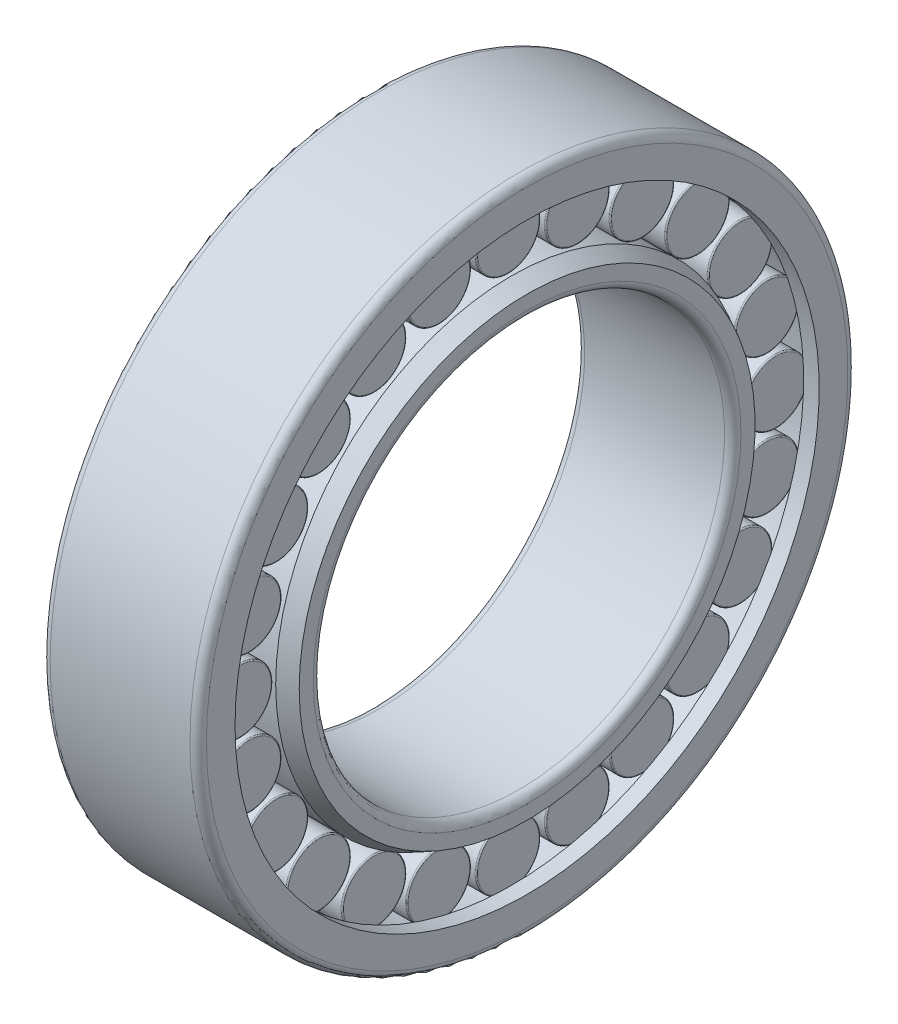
ISO-10303-21;
HEADER;
FILE_DESCRIPTION(('STEP AP214'),'2;1');
FILE_NAME('part.step','',(''),(''),'','','');
FILE_SCHEMA(('AUTOMOTIVE_DESIGN { 1 0 10303 214 1 1 1 1 }'));
ENDSEC;
DATA;
#1=APPLICATION_CONTEXT('core data for automotive mechanical design processes');
#2=APPLICATION_PROTOCOL_DEFINITION('international standard','automotive_design',2000,#1);
#3=PRODUCT_CONTEXT('',#1,'mechanical');
#4=PRODUCT('Part','Part','',(#3));
#5=PRODUCT_RELATED_PRODUCT_CATEGORY('part','',(#4));
#6=PRODUCT_DEFINITION_FORMATION('','',#4);
#7=PRODUCT_DEFINITION_CONTEXT('part definition',#1,'design');
#8=PRODUCT_DEFINITION('design','',#6,#7);
#9=PRODUCT_DEFINITION_SHAPE('','',#8);
#10=(LENGTH_UNIT() NAMED_UNIT(*) SI_UNIT(.MILLI.,.METRE.));
#11=(NAMED_UNIT(*) PLANE_ANGLE_UNIT() SI_UNIT($,.RADIAN.));
#12=(NAMED_UNIT(*) SI_UNIT($,.STERADIAN.) SOLID_ANGLE_UNIT());
#13=UNCERTAINTY_MEASURE_WITH_UNIT(LENGTH_MEASURE(1.E-05),#10,'distance_accuracy_value','');
#14=(GEOMETRIC_REPRESENTATION_CONTEXT(3) GLOBAL_UNCERTAINTY_ASSIGNED_CONTEXT((#13)) GLOBAL_UNIT_ASSIGNED_CONTEXT((#10,
#11,#12)) REPRESENTATION_CONTEXT('',''));
#15=CARTESIAN_POINT('',(0.,0.,0.));
#16=DIRECTION('',(0.,0.,1.));
#17=DIRECTION('',(1.,0.,0.));
#18=AXIS2_PLACEMENT_3D('',#15,#16,#17);
#19=CARTESIAN_POINT('',(7.22,27.8428119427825,7.46045897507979));
#20=DIRECTION('',(1.,0.,0.));
#21=DIRECTION('',(0.,0.258819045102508,-0.965925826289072));
#22=AXIS2_PLACEMENT_3D('',#19,#20,#21);
#23=PLANE('',#22);
#24=CARTESIAN_POINT('',(7.22,31.4674486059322,8.43167744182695));
#25=DIRECTION('',(-1.,0.,0.));
#26=DIRECTION('',(0.,-0.258819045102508,0.965925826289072));
#27=AXIS2_PLACEMENT_3D('',#24,#25,#26);
#28=CIRCLE('',#27,3.7525);
#29=CARTESIAN_POINT('',(7.22,30.4962301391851,12.0563141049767));
#30=VERTEX_POINT('',#29);
#31=EDGE_CURVE('E61',#30,#30,#28,.T.);
#32=ORIENTED_EDGE('',*,*,#31,.F.);
#33=EDGE_LOOP('',(#32));
#34=FACE_BOUND('',#33,.T.);
#35=ADVANCED_FACE('F46',(#34),#23,.T.);
#36=CARTESIAN_POINT('',(-7.22,27.8428119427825,7.46045897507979));
#37=DIRECTION('',(-1.,0.,0.));
#38=DIRECTION('',(0.,-0.258819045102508,0.965925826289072));
#39=AXIS2_PLACEMENT_3D('',#36,#37,#38);
#40=PLANE('',#39);
#41=CARTESIAN_POINT('',(-7.22,31.4674486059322,8.43167744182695));
#42=DIRECTION('',(-1.,0.,0.));
#43=DIRECTION('',(0.,-0.258819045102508,0.965925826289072));
#44=AXIS2_PLACEMENT_3D('',#41,#42,#43);
#45=CIRCLE('',#44,3.7525);
#46=CARTESIAN_POINT('',(-7.22,30.4962301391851,12.0563141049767));
#47=VERTEX_POINT('',#46);
#48=EDGE_CURVE('E12',#47,#47,#45,.T.);
#49=ORIENTED_EDGE('',*,*,#48,.T.);
#50=EDGE_LOOP('',(#49));
#51=FACE_BOUND('',#50,.T.);
#52=ADVANCED_FACE('F76',(#51),#40,.T.);
#53=CARTESIAN_POINT('',(-7.07,31.4674486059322,8.43167744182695));
#54=DIRECTION('',(-1.,0.,0.));
#55=DIRECTION('',(0.,-0.258819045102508,0.965925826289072));
#56=AXIS2_PLACEMENT_3D('',#53,#54,#55);
#57=TOROIDAL_SURFACE('',#56,3.7525,0.15);
#58=CARTESIAN_POINT('',(-7.07,31.4674486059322,8.43167744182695));
#59=DIRECTION('',(-1.,0.,0.));
#60=DIRECTION('',(0.,-0.258819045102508,0.965925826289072));
#61=AXIS2_PLACEMENT_3D('',#58,#59,#60);
#62=CIRCLE('',#61,3.9025);
#63=CARTESIAN_POINT('',(-7.07,30.4574072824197,12.2012029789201));
#64=VERTEX_POINT('',#63);
#65=EDGE_CURVE('E53',#64,#64,#62,.T.);
#66=ORIENTED_EDGE('',*,*,#65,.T.);
#67=EDGE_LOOP('',(#66));
#68=FACE_BOUND('',#67,.T.);
#69=ORIENTED_EDGE('',*,*,#48,.F.);
#70=EDGE_LOOP('',(#69));
#71=FACE_BOUND('',#70,.T.);
#72=ADVANCED_FACE('F80',(#68,#71),#57,.T.);
#73=CARTESIAN_POINT('',(-10.1307668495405,31.4674486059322,8.43167744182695));
#74=DIRECTION('',(-1.,0.,0.));
#75=DIRECTION('',(0.,-0.258819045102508,0.965925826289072));
#76=AXIS2_PLACEMENT_3D('',#73,#74,#75);
#77=CYLINDRICAL_SURFACE('',#76,3.9025);
#78=CARTESIAN_POINT('',(7.07,31.4674486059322,8.43167744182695));
#79=DIRECTION('',(-1.,0.,0.));
#80=DIRECTION('',(0.,-0.258819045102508,0.965925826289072));
#81=AXIS2_PLACEMENT_3D('',#78,#79,#80);
#82=CIRCLE('',#81,3.9025);
#83=CARTESIAN_POINT('',(7.07,30.4574072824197,12.2012029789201));
#84=VERTEX_POINT('',#83);
#85=EDGE_CURVE('E57',#84,#84,#82,.T.);
#86=ORIENTED_EDGE('',*,*,#85,.T.);
#87=EDGE_LOOP('',(#86));
#88=FACE_BOUND('',#87,.T.);
#89=ORIENTED_EDGE('',*,*,#65,.F.);
#90=EDGE_LOOP('',(#89));
#91=FACE_BOUND('',#90,.T.);
#92=ADVANCED_FACE('F84',(#88,#91),#77,.T.);
#93=CARTESIAN_POINT('',(7.07,31.4674486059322,8.43167744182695));
#94=DIRECTION('',(-1.,0.,0.));
#95=DIRECTION('',(0.,-0.258819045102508,0.965925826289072));
#96=AXIS2_PLACEMENT_3D('',#93,#94,#95);
#97=TOROIDAL_SURFACE('',#96,3.7525,0.15);
#98=ORIENTED_EDGE('',*,*,#31,.T.);
#99=EDGE_LOOP('',(#98));
#100=FACE_BOUND('',#99,.T.);
#101=ORIENTED_EDGE('',*,*,#85,.F.);
#102=EDGE_LOOP('',(#101));
#103=FACE_BOUND('',#102,.T.);
#104=ADVANCED_FACE('F72',(#100,#103),#97,.T.);
#105=CLOSED_SHELL('',(#35,#52,#72,#92,#104));
#106=MANIFOLD_SOLID_BREP('B2',#105);
#107=CARTESIAN_POINT('',(7.22,24.9631822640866,14.4124999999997));
#108=DIRECTION('',(1.,0.,0.));
#109=DIRECTION('',(0.,0.499999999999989,-0.866025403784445));
#110=AXIS2_PLACEMENT_3D('',#107,#108,#109);
#111=PLANE('',#110);
#112=CARTESIAN_POINT('',(7.22,28.2129425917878,16.2887499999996));
#113=DIRECTION('',(-1.,0.,0.));
#114=DIRECTION('',(0.,-0.499999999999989,0.866025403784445));
#115=AXIS2_PLACEMENT_3D('',#112,#113,#114);
#116=CIRCLE('',#115,3.7525);
#117=CARTESIAN_POINT('',(7.22,26.3366925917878,19.5385103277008));
#118=VERTEX_POINT('',#117);
#119=EDGE_CURVE('E148',#118,#118,#116,.T.);
#120=ORIENTED_EDGE('',*,*,#119,.F.);
#121=EDGE_LOOP('',(#120));
#122=FACE_BOUND('',#121,.T.);
#123=ADVANCED_FACE('F133',(#122),#111,.T.);
#124=CARTESIAN_POINT('',(-7.22,24.9631822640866,14.4124999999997));
#125=DIRECTION('',(-1.,0.,0.));
#126=DIRECTION('',(0.,-0.499999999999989,0.866025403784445));
#127=AXIS2_PLACEMENT_3D('',#124,#125,#126);
#128=PLANE('',#127);
#129=CARTESIAN_POINT('',(-7.22,28.2129425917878,16.2887499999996));
#130=DIRECTION('',(-1.,0.,0.));
#131=DIRECTION('',(0.,-0.499999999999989,0.866025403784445));
#132=AXIS2_PLACEMENT_3D('',#129,#130,#131);
#133=CIRCLE('',#132,3.7525);
#134=CARTESIAN_POINT('',(-7.22,26.3366925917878,19.5385103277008));
#135=VERTEX_POINT('',#134);
#136=EDGE_CURVE('E45',#135,#135,#133,.T.);
#137=ORIENTED_EDGE('',*,*,#136,.T.);
#138=EDGE_LOOP('',(#137));
#139=FACE_BOUND('',#138,.T.);
#140=ADVANCED_FACE('F162',(#139),#128,.T.);
#141=CARTESIAN_POINT('',(-7.07,28.2129425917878,16.2887499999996));
#142=DIRECTION('',(-1.,0.,0.));
#143=DIRECTION('',(0.,-0.499999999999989,0.866025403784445));
#144=AXIS2_PLACEMENT_3D('',#141,#142,#143);
#145=TOROIDAL_SURFACE('',#144,3.7525,0.15);
#146=CARTESIAN_POINT('',(-7.07,28.2129425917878,16.2887499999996));
#147=DIRECTION('',(-1.,0.,0.));
#148=DIRECTION('',(0.,-0.499999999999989,0.866025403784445));
#149=AXIS2_PLACEMENT_3D('',#146,#147,#148);
#150=CIRCLE('',#149,3.9025);
#151=CARTESIAN_POINT('',(-7.07,26.2616925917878,19.6684141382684));
#152=VERTEX_POINT('',#151);
#153=EDGE_CURVE('E140',#152,#152,#150,.T.);
#154=ORIENTED_EDGE('',*,*,#153,.T.);
#155=EDGE_LOOP('',(#154));
#156=FACE_BOUND('',#155,.T.);
#157=ORIENTED_EDGE('',*,*,#136,.F.);
#158=EDGE_LOOP('',(#157));
#159=FACE_BOUND('',#158,.T.);
#160=ADVANCED_FACE('F166',(#156,#159),#145,.T.);
#161=CARTESIAN_POINT('',(-10.1307668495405,28.2129425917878,16.2887499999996));
#162=DIRECTION('',(-1.,0.,0.));
#163=DIRECTION('',(0.,-0.499999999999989,0.866025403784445));
#164=AXIS2_PLACEMENT_3D('',#161,#162,#163);
#165=CYLINDRICAL_SURFACE('',#164,3.9025);
#166=CARTESIAN_POINT('',(7.07,28.2129425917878,16.2887499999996));
#167=DIRECTION('',(-1.,0.,0.));
#168=DIRECTION('',(0.,-0.499999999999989,0.866025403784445));
#169=AXIS2_PLACEMENT_3D('',#166,#167,#168);
#170=CIRCLE('',#169,3.9025);
#171=CARTESIAN_POINT('',(7.07,26.2616925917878,19.6684141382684));
#172=VERTEX_POINT('',#171);
#173=EDGE_CURVE('E144',#172,#172,#170,.T.);
#174=ORIENTED_EDGE('',*,*,#173,.T.);
#175=EDGE_LOOP('',(#174));
#176=FACE_BOUND('',#175,.T.);
#177=ORIENTED_EDGE('',*,*,#153,.F.);
#178=EDGE_LOOP('',(#177));
#179=FACE_BOUND('',#178,.T.);
#180=ADVANCED_FACE('F170',(#176,#179),#165,.T.);
#181=CARTESIAN_POINT('',(7.07,28.2129425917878,16.2887499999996));
#182=DIRECTION('',(-1.,0.,0.));
#183=DIRECTION('',(0.,-0.499999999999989,0.866025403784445));
#184=AXIS2_PLACEMENT_3D('',#181,#182,#183);
#185=TOROIDAL_SURFACE('',#184,3.7525,0.15);
#186=ORIENTED_EDGE('',*,*,#119,.T.);
#187=EDGE_LOOP('',(#186));
#188=FACE_BOUND('',#187,.T.);
#189=ORIENTED_EDGE('',*,*,#173,.F.);
#190=EDGE_LOOP('',(#189));
#191=FACE_BOUND('',#190,.T.);
#192=ADVANCED_FACE('F158',(#188,#191),#185,.T.);
#193=CLOSED_SHELL('',(#123,#140,#160,#180,#192));
#194=MANIFOLD_SOLID_BREP('B7',#193);
#195=CARTESIAN_POINT('',(7.22,20.3823529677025,20.382352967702));
#196=DIRECTION('',(1.,0.,0.));
#197=DIRECTION('',(0.,0.707106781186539,-0.707106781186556));
#198=AXIS2_PLACEMENT_3D('',#195,#196,#197);
#199=PLANE('',#198);
#200=CARTESIAN_POINT('',(7.22,23.035771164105,23.0357711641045));
#201=DIRECTION('',(-1.,0.,0.));
#202=DIRECTION('',(0.,-0.707106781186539,0.707106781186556));
#203=AXIS2_PLACEMENT_3D('',#200,#201,#202);
#204=CIRCLE('',#203,3.7525);
#205=CARTESIAN_POINT('',(7.22,20.3823529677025,25.689189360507));
#206=VERTEX_POINT('',#205);
#207=EDGE_CURVE('E233',#206,#206,#204,.T.);
#208=ORIENTED_EDGE('',*,*,#207,.F.);
#209=EDGE_LOOP('',(#208));
#210=FACE_BOUND('',#209,.T.);
#211=ADVANCED_FACE('F218',(#210),#199,.T.);
#212=CARTESIAN_POINT('',(-7.22,20.3823529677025,20.382352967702));
#213=DIRECTION('',(-1.,0.,0.));
#214=DIRECTION('',(0.,-0.707106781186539,0.707106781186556));
#215=AXIS2_PLACEMENT_3D('',#212,#213,#214);
#216=PLANE('',#215);
#217=CARTESIAN_POINT('',(-7.22,23.035771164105,23.0357711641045));
#218=DIRECTION('',(-1.,0.,0.));
#219=DIRECTION('',(0.,-0.707106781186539,0.707106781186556));
#220=AXIS2_PLACEMENT_3D('',#217,#218,#219);
#221=CIRCLE('',#220,3.7525);
#222=CARTESIAN_POINT('',(-7.22,20.3823529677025,25.689189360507));
#223=VERTEX_POINT('',#222);
#224=EDGE_CURVE('E132',#223,#223,#221,.T.);
#225=ORIENTED_EDGE('',*,*,#224,.T.);
#226=EDGE_LOOP('',(#225));
#227=FACE_BOUND('',#226,.T.);
#228=ADVANCED_FACE('F248',(#227),#216,.T.);
#229=CARTESIAN_POINT('',(-7.07,23.035771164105,23.0357711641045));
#230=DIRECTION('',(-1.,0.,0.));
#231=DIRECTION('',(0.,-0.707106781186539,0.707106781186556));
#232=AXIS2_PLACEMENT_3D('',#229,#230,#231);
#233=TOROIDAL_SURFACE('',#232,3.7525,0.15);
#234=CARTESIAN_POINT('',(-7.07,23.035771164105,23.0357711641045));
#235=DIRECTION('',(-1.,0.,0.));
#236=DIRECTION('',(0.,-0.707106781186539,0.707106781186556));
#237=AXIS2_PLACEMENT_3D('',#234,#235,#236);
#238=CIRCLE('',#237,3.9025);
#239=CARTESIAN_POINT('',(-7.07,20.2762869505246,25.795255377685));
#240=VERTEX_POINT('',#239);
#241=EDGE_CURVE('E225',#240,#240,#238,.T.);
#242=ORIENTED_EDGE('',*,*,#241,.T.);
#243=EDGE_LOOP('',(#242));
#244=FACE_BOUND('',#243,.T.);
#245=ORIENTED_EDGE('',*,*,#224,.F.);
#246=EDGE_LOOP('',(#245));
#247=FACE_BOUND('',#246,.T.);
#248=ADVANCED_FACE('F252',(#244,#247),#233,.T.);
#249=CARTESIAN_POINT('',(-10.1307668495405,23.035771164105,23.0357711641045));
#250=DIRECTION('',(-1.,0.,0.));
#251=DIRECTION('',(0.,-0.707106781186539,0.707106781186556));
#252=AXIS2_PLACEMENT_3D('',#249,#250,#251);
#253=CYLINDRICAL_SURFACE('',#252,3.9025);
#254=CARTESIAN_POINT('',(7.07,23.035771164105,23.0357711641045));
#255=DIRECTION('',(-1.,0.,0.));
#256=DIRECTION('',(0.,-0.707106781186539,0.707106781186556));
#257=AXIS2_PLACEMENT_3D('',#254,#255,#256);
#258=CIRCLE('',#257,3.9025);
#259=CARTESIAN_POINT('',(7.07,20.2762869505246,25.795255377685));
#260=VERTEX_POINT('',#259);
#261=EDGE_CURVE('E229',#260,#260,#258,.T.);
#262=ORIENTED_EDGE('',*,*,#261,.T.);
#263=EDGE_LOOP('',(#262));
#264=FACE_BOUND('',#263,.T.);
#265=ORIENTED_EDGE('',*,*,#241,.F.);
#266=EDGE_LOOP('',(#265));
#267=FACE_BOUND('',#266,.T.);
#268=ADVANCED_FACE('F256',(#264,#267),#253,.T.);
#269=CARTESIAN_POINT('',(7.07,23.035771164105,23.0357711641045));
#270=DIRECTION('',(-1.,0.,0.));
#271=DIRECTION('',(0.,-0.707106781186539,0.707106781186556));
#272=AXIS2_PLACEMENT_3D('',#269,#270,#271);
#273=TOROIDAL_SURFACE('',#272,3.7525,0.15);
#274=ORIENTED_EDGE('',*,*,#207,.T.);
#275=EDGE_LOOP('',(#274));
#276=FACE_BOUND('',#275,.T.);
#277=ORIENTED_EDGE('',*,*,#261,.F.);
#278=EDGE_LOOP('',(#277));
#279=FACE_BOUND('',#278,.T.);
#280=ADVANCED_FACE('F244',(#276,#279),#273,.T.);
#281=CLOSED_SHELL('',(#211,#228,#248,#268,#280));
#282=MANIFOLD_SOLID_BREP('B40',#281);
#283=CARTESIAN_POINT('',(7.22,14.4125000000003,24.9631822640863));
#284=DIRECTION('',(1.,0.,0.));
#285=DIRECTION('',(0.,0.866025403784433,-0.50000000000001));
#286=AXIS2_PLACEMENT_3D('',#283,#284,#285);
#287=PLANE('',#286);
#288=CARTESIAN_POINT('',(7.22,16.2887500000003,28.2129425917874));
#289=DIRECTION('',(-1.,0.,0.));
#290=DIRECTION('',(0.,-0.866025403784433,0.50000000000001));
#291=AXIS2_PLACEMENT_3D('',#288,#289,#290);
#292=CIRCLE('',#291,3.7525);
#293=CARTESIAN_POINT('',(7.22,13.0389896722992,30.0891925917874));
#294=VERTEX_POINT('',#293);
#295=EDGE_CURVE('E320',#294,#294,#292,.T.);
#296=ORIENTED_EDGE('',*,*,#295,.F.);
#297=EDGE_LOOP('',(#296));
#298=FACE_BOUND('',#297,.T.);
#299=ADVANCED_FACE('F305',(#298),#287,.T.);
#300=CARTESIAN_POINT('',(-7.22,14.4125000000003,24.9631822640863));
#301=DIRECTION('',(-1.,0.,0.));
#302=DIRECTION('',(0.,-0.866025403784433,0.50000000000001));
#303=AXIS2_PLACEMENT_3D('',#300,#301,#302);
#304=PLANE('',#303);
#305=CARTESIAN_POINT('',(-7.22,16.2887500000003,28.2129425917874));
#306=DIRECTION('',(-1.,0.,0.));
#307=DIRECTION('',(0.,-0.866025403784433,0.50000000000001));
#308=AXIS2_PLACEMENT_3D('',#305,#306,#307);
#309=CIRCLE('',#308,3.7525);
#310=CARTESIAN_POINT('',(-7.22,13.0389896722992,30.0891925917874));
#311=VERTEX_POINT('',#310);
#312=EDGE_CURVE('E217',#311,#311,#309,.T.);
#313=ORIENTED_EDGE('',*,*,#312,.T.);
#314=EDGE_LOOP('',(#313));
#315=FACE_BOUND('',#314,.T.);
#316=ADVANCED_FACE('F334',(#315),#304,.T.);
#317=CARTESIAN_POINT('',(-7.07,16.2887500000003,28.2129425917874));
#318=DIRECTION('',(-1.,0.,0.));
#319=DIRECTION('',(0.,-0.866025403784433,0.50000000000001));
#320=AXIS2_PLACEMENT_3D('',#317,#318,#319);
#321=TOROIDAL_SURFACE('',#320,3.7525,0.15);
#322=CARTESIAN_POINT('',(-7.07,16.2887500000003,28.2129425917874));
#323=DIRECTION('',(-1.,0.,0.));
#324=DIRECTION('',(0.,-0.866025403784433,0.50000000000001));
#325=AXIS2_PLACEMENT_3D('',#322,#323,#324);
#326=CIRCLE('',#325,3.9025);
#327=CARTESIAN_POINT('',(-7.07,12.9090858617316,30.1641925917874));
#328=VERTEX_POINT('',#327);
#329=EDGE_CURVE('E312',#328,#328,#326,.T.);
#330=ORIENTED_EDGE('',*,*,#329,.T.);
#331=EDGE_LOOP('',(#330));
#332=FACE_BOUND('',#331,.T.);
#333=ORIENTED_EDGE('',*,*,#312,.F.);
#334=EDGE_LOOP('',(#333));
#335=FACE_BOUND('',#334,.T.);
#336=ADVANCED_FACE('F338',(#332,#335),#321,.T.);
#337=CARTESIAN_POINT('',(-10.1307668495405,16.2887500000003,28.2129425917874));
#338=DIRECTION('',(-1.,0.,0.));
#339=DIRECTION('',(0.,-0.866025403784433,0.50000000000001));
#340=AXIS2_PLACEMENT_3D('',#337,#338,#339);
#341=CYLINDRICAL_SURFACE('',#340,3.9025);
#342=CARTESIAN_POINT('',(7.07,16.2887500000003,28.2129425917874));
#343=DIRECTION('',(-1.,0.,0.));
#344=DIRECTION('',(0.,-0.866025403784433,0.50000000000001));
#345=AXIS2_PLACEMENT_3D('',#342,#343,#344);
#346=CIRCLE('',#345,3.9025);
#347=CARTESIAN_POINT('',(7.07,12.9090858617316,30.1641925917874));
#348=VERTEX_POINT('',#347);
#349=EDGE_CURVE('E316',#348,#348,#346,.T.);
#350=ORIENTED_EDGE('',*,*,#349,.T.);
#351=EDGE_LOOP('',(#350));
#352=FACE_BOUND('',#351,.T.);
#353=ORIENTED_EDGE('',*,*,#329,.F.);
#354=EDGE_LOOP('',(#353));
#355=FACE_BOUND('',#354,.T.);
#356=ADVANCED_FACE('F342',(#352,#355),#341,.T.);
#357=CARTESIAN_POINT('',(7.07,16.2887500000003,28.2129425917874));
#358=DIRECTION('',(-1.,0.,0.));
#359=DIRECTION('',(0.,-0.866025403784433,0.50000000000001));
#360=AXIS2_PLACEMENT_3D('',#357,#358,#359);
#361=TOROIDAL_SURFACE('',#360,3.7525,0.15);
#362=ORIENTED_EDGE('',*,*,#295,.T.);
#363=EDGE_LOOP('',(#362));
#364=FACE_BOUND('',#363,.T.);
#365=ORIENTED_EDGE('',*,*,#349,.F.);
#366=EDGE_LOOP('',(#365));
#367=FACE_BOUND('',#366,.T.);
#368=ADVANCED_FACE('F330',(#364,#367),#361,.T.);
#369=CLOSED_SHELL('',(#299,#316,#336,#356,#368));
#370=MANIFOLD_SOLID_BREP('B127',#369);
#371=CARTESIAN_POINT('',(7.22,7.46045897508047,27.8428119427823));
#372=DIRECTION('',(1.,0.,0.));
#373=DIRECTION('',(0.,0.965925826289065,-0.258819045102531));
#374=AXIS2_PLACEMENT_3D('',#371,#372,#373);
#375=PLANE('',#374);
#376=CARTESIAN_POINT('',(7.22,8.43167744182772,31.467448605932));
#377=DIRECTION('',(-1.,0.,0.));
#378=DIRECTION('',(0.,-0.965925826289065,0.258819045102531));
#379=AXIS2_PLACEMENT_3D('',#376,#377,#378);
#380=CIRCLE('',#379,3.7525);
#381=CARTESIAN_POINT('',(7.22,4.807040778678,32.4386670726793));
#382=VERTEX_POINT('',#381);
#383=EDGE_CURVE('E406',#382,#382,#380,.T.);
#384=ORIENTED_EDGE('',*,*,#383,.F.);
#385=EDGE_LOOP('',(#384));
#386=FACE_BOUND('',#385,.T.);
#387=ADVANCED_FACE('F391',(#386),#375,.T.);
#388=CARTESIAN_POINT('',(-7.22,7.46045897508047,27.8428119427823));
#389=DIRECTION('',(-1.,0.,0.));
#390=DIRECTION('',(0.,-0.965925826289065,0.258819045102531));
#391=AXIS2_PLACEMENT_3D('',#388,#389,#390);
#392=PLANE('',#391);
#393=CARTESIAN_POINT('',(-7.22,8.43167744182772,31.467448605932));
#394=DIRECTION('',(-1.,0.,0.));
#395=DIRECTION('',(0.,-0.965925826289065,0.258819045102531));
#396=AXIS2_PLACEMENT_3D('',#393,#394,#395);
#397=CIRCLE('',#396,3.7525);
#398=CARTESIAN_POINT('',(-7.22,4.807040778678,32.4386670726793));
#399=VERTEX_POINT('',#398);
#400=EDGE_CURVE('E304',#399,#399,#397,.T.);
#401=ORIENTED_EDGE('',*,*,#400,.T.);
#402=EDGE_LOOP('',(#401));
#403=FACE_BOUND('',#402,.T.);
#404=ADVANCED_FACE('F420',(#403),#392,.T.);
#405=CARTESIAN_POINT('',(-7.07,8.43167744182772,31.467448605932));
#406=DIRECTION('',(-1.,0.,0.));
#407=DIRECTION('',(0.,-0.965925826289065,0.258819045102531));
#408=AXIS2_PLACEMENT_3D('',#405,#406,#407);
#409=TOROIDAL_SURFACE('',#408,3.7525,0.15);
#410=CARTESIAN_POINT('',(-7.07,8.43167744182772,31.467448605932));
#411=DIRECTION('',(-1.,0.,0.));
#412=DIRECTION('',(0.,-0.965925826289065,0.258819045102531));
#413=AXIS2_PLACEMENT_3D('',#410,#411,#412);
#414=CIRCLE('',#413,3.9025);
#415=CARTESIAN_POINT('',(-7.07,4.66215190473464,32.4774899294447));
#416=VERTEX_POINT('',#415);
#417=EDGE_CURVE('E398',#416,#416,#414,.T.);
#418=ORIENTED_EDGE('',*,*,#417,.T.);
#419=EDGE_LOOP('',(#418));
#420=FACE_BOUND('',#419,.T.);
#421=ORIENTED_EDGE('',*,*,#400,.F.);
#422=EDGE_LOOP('',(#421));
#423=FACE_BOUND('',#422,.T.);
#424=ADVANCED_FACE('F424',(#420,#423),#409,.T.);
#425=CARTESIAN_POINT('',(-10.1307668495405,8.43167744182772,31.467448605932));
#426=DIRECTION('',(-1.,0.,0.));
#427=DIRECTION('',(0.,-0.965925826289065,0.258819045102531));
#428=AXIS2_PLACEMENT_3D('',#425,#426,#427);
#429=CYLINDRICAL_SURFACE('',#428,3.9025);
#430=CARTESIAN_POINT('',(7.07,8.43167744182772,31.467448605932));
#431=DIRECTION('',(-1.,0.,0.));
#432=DIRECTION('',(0.,-0.965925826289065,0.258819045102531));
#433=AXIS2_PLACEMENT_3D('',#430,#431,#432);
#434=CIRCLE('',#433,3.9025);
#435=CARTESIAN_POINT('',(7.07,4.66215190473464,32.4774899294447));
#436=VERTEX_POINT('',#435);
#437=EDGE_CURVE('E402',#436,#436,#434,.T.);
#438=ORIENTED_EDGE('',*,*,#437,.T.);
#439=EDGE_LOOP('',(#438));
#440=FACE_BOUND('',#439,.T.);
#441=ORIENTED_EDGE('',*,*,#417,.F.);
#442=EDGE_LOOP('',(#441));
#443=FACE_BOUND('',#442,.T.);
#444=ADVANCED_FACE('F428',(#440,#443),#429,.T.);
#445=CARTESIAN_POINT('',(7.07,8.43167744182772,31.467448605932));
#446=DIRECTION('',(-1.,0.,0.));
#447=DIRECTION('',(0.,-0.965925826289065,0.258819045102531));
#448=AXIS2_PLACEMENT_3D('',#445,#446,#447);
#449=TOROIDAL_SURFACE('',#448,3.7525,0.15);
#450=ORIENTED_EDGE('',*,*,#383,.T.);
#451=EDGE_LOOP('',(#450));
#452=FACE_BOUND('',#451,.T.);
#453=ORIENTED_EDGE('',*,*,#437,.F.);
#454=EDGE_LOOP('',(#453));
#455=FACE_BOUND('',#454,.T.);
#456=ADVANCED_FACE('F416',(#452,#455),#449,.T.);
#457=CLOSED_SHELL('',(#387,#404,#424,#444,#456));
#458=MANIFOLD_SOLID_BREP('B212',#457);
#459=CARTESIAN_POINT('',(7.22,3.0192584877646E-13,28.825));
#460=DIRECTION('',(1.,0.,0.));
#461=DIRECTION('',(0.,1.,0.));
#462=AXIS2_PLACEMENT_3D('',#459,#460,#461);
#463=PLANE('',#462);
#464=CARTESIAN_POINT('',(7.22,3.41231199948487E-13,32.5775));
#465=DIRECTION('',(-1.,0.,0.));
#466=DIRECTION('',(0.,-1.,0.));
#467=AXIS2_PLACEMENT_3D('',#464,#465,#466);
#468=CIRCLE('',#467,3.7525);
#469=CARTESIAN_POINT('',(7.22,-3.75249999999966,32.5775));
#470=VERTEX_POINT('',#469);
#471=EDGE_CURVE('E491',#470,#470,#468,.T.);
#472=ORIENTED_EDGE('',*,*,#471,.F.);
#473=EDGE_LOOP('',(#472));
#474=FACE_BOUND('',#473,.T.);
#475=ADVANCED_FACE('F476',(#474),#463,.T.);
#476=CARTESIAN_POINT('',(-7.22,3.0192584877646E-13,28.825));
#477=DIRECTION('',(-1.,0.,0.));
#478=DIRECTION('',(0.,-1.,0.));
#479=AXIS2_PLACEMENT_3D('',#476,#477,#478);
#480=PLANE('',#479);
#481=CARTESIAN_POINT('',(-7.22,3.41231199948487E-13,32.5775));
#482=DIRECTION('',(-1.,0.,0.));
#483=DIRECTION('',(0.,-1.,0.));
#484=AXIS2_PLACEMENT_3D('',#481,#482,#483);
#485=CIRCLE('',#484,3.7525);
#486=CARTESIAN_POINT('',(-7.22,-3.75249999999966,32.5775));
#487=VERTEX_POINT('',#486);
#488=EDGE_CURVE('E390',#487,#487,#485,.T.);
#489=ORIENTED_EDGE('',*,*,#488,.T.);
#490=EDGE_LOOP('',(#489));
#491=FACE_BOUND('',#490,.T.);
#492=ADVANCED_FACE('F506',(#491),#480,.T.);
#493=CARTESIAN_POINT('',(-7.07,3.41231199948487E-13,32.5775));
#494=DIRECTION('',(-1.,0.,0.));
#495=DIRECTION('',(0.,-1.,0.));
#496=AXIS2_PLACEMENT_3D('',#493,#494,#495);
#497=TOROIDAL_SURFACE('',#496,3.7525,0.15);
#498=CARTESIAN_POINT('',(-7.07,3.41231199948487E-13,32.5775));
#499=DIRECTION('',(-1.,0.,0.));
#500=DIRECTION('',(0.,-1.,0.));
#501=AXIS2_PLACEMENT_3D('',#498,#499,#500);
#502=CIRCLE('',#501,3.9025);
#503=CARTESIAN_POINT('',(-7.07,-3.90249999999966,32.5775));
#504=VERTEX_POINT('',#503);
#505=EDGE_CURVE('E483',#504,#504,#502,.T.);
#506=ORIENTED_EDGE('',*,*,#505,.T.);
#507=EDGE_LOOP('',(#506));
#508=FACE_BOUND('',#507,.T.);
#509=ORIENTED_EDGE('',*,*,#488,.F.);
#510=EDGE_LOOP('',(#509));
#511=FACE_BOUND('',#510,.T.);
#512=ADVANCED_FACE('F510',(#508,#511),#497,.T.);
#513=CARTESIAN_POINT('',(-10.1307668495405,3.41231199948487E-13,32.5775));
#514=DIRECTION('',(-1.,0.,0.));
#515=DIRECTION('',(0.,-1.,0.));
#516=AXIS2_PLACEMENT_3D('',#513,#514,#515);
#517=CYLINDRICAL_SURFACE('',#516,3.9025);
#518=CARTESIAN_POINT('',(7.07,3.41231199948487E-13,32.5775));
#519=DIRECTION('',(-1.,0.,0.));
#520=DIRECTION('',(0.,-1.,0.));
#521=AXIS2_PLACEMENT_3D('',#518,#519,#520);
#522=CIRCLE('',#521,3.9025);
#523=CARTESIAN_POINT('',(7.07,-3.90249999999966,32.5775));
#524=VERTEX_POINT('',#523);
#525=EDGE_CURVE('E487',#524,#524,#522,.T.);
#526=ORIENTED_EDGE('',*,*,#525,.T.);
#527=EDGE_LOOP('',(#526));
#528=FACE_BOUND('',#527,.T.);
#529=ORIENTED_EDGE('',*,*,#505,.F.);
#530=EDGE_LOOP('',(#529));
#531=FACE_BOUND('',#530,.T.);
#532=ADVANCED_FACE('F514',(#528,#531),#517,.T.);
#533=CARTESIAN_POINT('',(7.07,3.41231199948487E-13,32.5775));
#534=DIRECTION('',(-1.,0.,0.));
#535=DIRECTION('',(0.,-1.,0.));
#536=AXIS2_PLACEMENT_3D('',#533,#534,#535);
#537=TOROIDAL_SURFACE('',#536,3.7525,0.15);
#538=ORIENTED_EDGE('',*,*,#471,.T.);
#539=EDGE_LOOP('',(#538));
#540=FACE_BOUND('',#539,.T.);
#541=ORIENTED_EDGE('',*,*,#525,.F.);
#542=EDGE_LOOP('',(#541));
#543=FACE_BOUND('',#542,.T.);
#544=ADVANCED_FACE('F502',(#540,#543),#537,.T.);
#545=CLOSED_SHELL('',(#475,#492,#512,#532,#544));
#546=MANIFOLD_SOLID_BREP('B299',#545);
#547=CARTESIAN_POINT('',(7.22,-7.46045897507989,27.8428119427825));
#548=DIRECTION('',(1.,0.,0.));
#549=DIRECTION('',(0.,0.965925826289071,0.258819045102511));
#550=AXIS2_PLACEMENT_3D('',#547,#548,#549);
#551=PLANE('',#550);
#552=CARTESIAN_POINT('',(7.22,-8.43167744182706,31.4674486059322));
#553=DIRECTION('',(-1.,0.,0.));
#554=DIRECTION('',(0.,-0.965925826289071,-0.258819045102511));
#555=AXIS2_PLACEMENT_3D('',#552,#553,#554);
#556=CIRCLE('',#555,3.7525);
#557=CARTESIAN_POINT('',(7.22,-12.0563141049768,30.496230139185));
#558=VERTEX_POINT('',#557);
#559=EDGE_CURVE('E578',#558,#558,#556,.T.);
#560=ORIENTED_EDGE('',*,*,#559,.F.);
#561=EDGE_LOOP('',(#560));
#562=FACE_BOUND('',#561,.T.);
#563=ADVANCED_FACE('F563',(#562),#551,.T.);
#564=CARTESIAN_POINT('',(-7.22,-7.46045897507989,27.8428119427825));
#565=DIRECTION('',(-1.,0.,0.));
#566=DIRECTION('',(0.,-0.965925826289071,-0.258819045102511));
#567=AXIS2_PLACEMENT_3D('',#564,#565,#566);
#568=PLANE('',#567);
#569=CARTESIAN_POINT('',(-7.22,-8.43167744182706,31.4674486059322));
#570=DIRECTION('',(-1.,0.,0.));
#571=DIRECTION('',(0.,-0.965925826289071,-0.258819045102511));
#572=AXIS2_PLACEMENT_3D('',#569,#570,#571);
#573=CIRCLE('',#572,3.7525);
#574=CARTESIAN_POINT('',(-7.22,-12.0563141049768,30.496230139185));
#575=VERTEX_POINT('',#574);
#576=EDGE_CURVE('E475',#575,#575,#573,.T.);
#577=ORIENTED_EDGE('',*,*,#576,.T.);
#578=EDGE_LOOP('',(#577));
#579=FACE_BOUND('',#578,.T.);
#580=ADVANCED_FACE('F592',(#579),#568,.T.);
#581=CARTESIAN_POINT('',(-7.07,-8.43167744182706,31.4674486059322));
#582=DIRECTION('',(-1.,0.,0.));
#583=DIRECTION('',(0.,-0.965925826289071,-0.258819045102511));
#584=AXIS2_PLACEMENT_3D('',#581,#582,#583);
#585=TOROIDAL_SURFACE('',#584,3.7525,0.15);
#586=CARTESIAN_POINT('',(-7.07,-8.43167744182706,31.4674486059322));
#587=DIRECTION('',(-1.,0.,0.));
#588=DIRECTION('',(0.,-0.965925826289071,-0.258819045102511));
#589=AXIS2_PLACEMENT_3D('',#586,#587,#588);
#590=CIRCLE('',#589,3.9025);
#591=CARTESIAN_POINT('',(-7.07,-12.2012029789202,30.4574072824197));
#592=VERTEX_POINT('',#591);
#593=EDGE_CURVE('E570',#592,#592,#590,.T.);
#594=ORIENTED_EDGE('',*,*,#593,.T.);
#595=EDGE_LOOP('',(#594));
#596=FACE_BOUND('',#595,.T.);
#597=ORIENTED_EDGE('',*,*,#576,.F.);
#598=EDGE_LOOP('',(#597));
#599=FACE_BOUND('',#598,.T.);
#600=ADVANCED_FACE('F596',(#596,#599),#585,.T.);
#601=CARTESIAN_POINT('',(-10.1307668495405,-8.43167744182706,31.4674486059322));
#602=DIRECTION('',(-1.,0.,0.));
#603=DIRECTION('',(0.,-0.965925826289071,-0.258819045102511));
#604=AXIS2_PLACEMENT_3D('',#601,#602,#603);
#605=CYLINDRICAL_SURFACE('',#604,3.9025);
#606=CARTESIAN_POINT('',(7.07,-8.43167744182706,31.4674486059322));
#607=DIRECTION('',(-1.,0.,0.));
#608=DIRECTION('',(0.,-0.965925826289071,-0.258819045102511));
#609=AXIS2_PLACEMENT_3D('',#606,#607,#608);
#610=CIRCLE('',#609,3.9025);
#611=CARTESIAN_POINT('',(7.07,-12.2012029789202,30.4574072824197));
#612=VERTEX_POINT('',#611);
#613=EDGE_CURVE('E574',#612,#612,#610,.T.);
#614=ORIENTED_EDGE('',*,*,#613,.T.);
#615=EDGE_LOOP('',(#614));
#616=FACE_BOUND('',#615,.T.);
#617=ORIENTED_EDGE('',*,*,#593,.F.);
#618=EDGE_LOOP('',(#617));
#619=FACE_BOUND('',#618,.T.);
#620=ADVANCED_FACE('F600',(#616,#619),#605,.T.);
#621=CARTESIAN_POINT('',(7.07,-8.43167744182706,31.4674486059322));
#622=DIRECTION('',(-1.,0.,0.));
#623=DIRECTION('',(0.,-0.965925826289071,-0.258819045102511));
#624=AXIS2_PLACEMENT_3D('',#621,#622,#623);
#625=TOROIDAL_SURFACE('',#624,3.7525,0.15);
#626=ORIENTED_EDGE('',*,*,#559,.T.);
#627=EDGE_LOOP('',(#626));
#628=FACE_BOUND('',#627,.T.);
#629=ORIENTED_EDGE('',*,*,#613,.F.);
#630=EDGE_LOOP('',(#629));
#631=FACE_BOUND('',#630,.T.);
#632=ADVANCED_FACE('F588',(#628,#631),#625,.T.);
#633=CLOSED_SHELL('',(#563,#580,#600,#620,#632));
#634=MANIFOLD_SOLID_BREP('B385',#633);
#635=CARTESIAN_POINT('',(7.22,-14.4124999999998,24.9631822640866));
#636=DIRECTION('',(1.,0.,0.));
#637=DIRECTION('',(0.,0.866025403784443,0.499999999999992));
#638=AXIS2_PLACEMENT_3D('',#635,#636,#637);
#639=PLANE('',#638);
#640=CARTESIAN_POINT('',(7.22,-16.2887499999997,28.2129425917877));
#641=DIRECTION('',(-1.,0.,0.));
#642=DIRECTION('',(0.,-0.866025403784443,-0.499999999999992));
#643=AXIS2_PLACEMENT_3D('',#640,#641,#642);
#644=CIRCLE('',#643,3.7525);
#645=CARTESIAN_POINT('',(7.22,-19.5385103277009,26.3366925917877));
#646=VERTEX_POINT('',#645);
#647=EDGE_CURVE('E664',#646,#646,#644,.T.);
#648=ORIENTED_EDGE('',*,*,#647,.F.);
#649=EDGE_LOOP('',(#648));
#650=FACE_BOUND('',#649,.T.);
#651=ADVANCED_FACE('F649',(#650),#639,.T.);
#652=CARTESIAN_POINT('',(-7.22,-14.4124999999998,24.9631822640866));
#653=DIRECTION('',(-1.,0.,0.));
#654=DIRECTION('',(0.,-0.866025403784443,-0.499999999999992));
#655=AXIS2_PLACEMENT_3D('',#652,#653,#654);
#656=PLANE('',#655);
#657=CARTESIAN_POINT('',(-7.22,-16.2887499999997,28.2129425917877));
#658=DIRECTION('',(-1.,0.,0.));
#659=DIRECTION('',(0.,-0.866025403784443,-0.499999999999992));
#660=AXIS2_PLACEMENT_3D('',#657,#658,#659);
#661=CIRCLE('',#660,3.7525);
#662=CARTESIAN_POINT('',(-7.22,-19.5385103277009,26.3366925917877));
#663=VERTEX_POINT('',#662);
#664=EDGE_CURVE('E562',#663,#663,#661,.T.);
#665=ORIENTED_EDGE('',*,*,#664,.T.);
#666=EDGE_LOOP('',(#665));
#667=FACE_BOUND('',#666,.T.);
#668=ADVANCED_FACE('F678',(#667),#656,.T.);
#669=CARTESIAN_POINT('',(-7.07,-16.2887499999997,28.2129425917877));
#670=DIRECTION('',(-1.,0.,0.));
#671=DIRECTION('',(0.,-0.866025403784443,-0.499999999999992));
#672=AXIS2_PLACEMENT_3D('',#669,#670,#671);
#673=TOROIDAL_SURFACE('',#672,3.7525,0.15);
#674=CARTESIAN_POINT('',(-7.07,-16.2887499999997,28.2129425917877));
#675=DIRECTION('',(-1.,0.,0.));
#676=DIRECTION('',(0.,-0.866025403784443,-0.499999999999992));
#677=AXIS2_PLACEMENT_3D('',#674,#675,#676);
#678=CIRCLE('',#677,3.9025);
#679=CARTESIAN_POINT('',(-7.07,-19.6684141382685,26.2616925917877));
#680=VERTEX_POINT('',#679);
#681=EDGE_CURVE('E656',#680,#680,#678,.T.);
#682=ORIENTED_EDGE('',*,*,#681,.T.);
#683=EDGE_LOOP('',(#682));
#684=FACE_BOUND('',#683,.T.);
#685=ORIENTED_EDGE('',*,*,#664,.F.);
#686=EDGE_LOOP('',(#685));
#687=FACE_BOUND('',#686,.T.);
#688=ADVANCED_FACE('F682',(#684,#687),#673,.T.);
#689=CARTESIAN_POINT('',(-10.1307668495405,-16.2887499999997,28.2129425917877));
#690=DIRECTION('',(-1.,0.,0.));
#691=DIRECTION('',(0.,-0.866025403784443,-0.499999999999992));
#692=AXIS2_PLACEMENT_3D('',#689,#690,#691);
#693=CYLINDRICAL_SURFACE('',#692,3.9025);
#694=CARTESIAN_POINT('',(7.07,-16.2887499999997,28.2129425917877));
#695=DIRECTION('',(-1.,0.,0.));
#696=DIRECTION('',(0.,-0.866025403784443,-0.499999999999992));
#697=AXIS2_PLACEMENT_3D('',#694,#695,#696);
#698=CIRCLE('',#697,3.9025);
#699=CARTESIAN_POINT('',(7.07,-19.6684141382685,26.2616925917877));
#700=VERTEX_POINT('',#699);
#701=EDGE_CURVE('E660',#700,#700,#698,.T.);
#702=ORIENTED_EDGE('',*,*,#701,.T.);
#703=EDGE_LOOP('',(#702));
#704=FACE_BOUND('',#703,.T.);
#705=ORIENTED_EDGE('',*,*,#681,.F.);
#706=EDGE_LOOP('',(#705));
#707=FACE_BOUND('',#706,.T.);
#708=ADVANCED_FACE('F686',(#704,#707),#693,.T.);
#709=CARTESIAN_POINT('',(7.07,-16.2887499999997,28.2129425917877));
#710=DIRECTION('',(-1.,0.,0.));
#711=DIRECTION('',(0.,-0.866025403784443,-0.499999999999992));
#712=AXIS2_PLACEMENT_3D('',#709,#710,#711);
#713=TOROIDAL_SURFACE('',#712,3.7525,0.15);
#714=ORIENTED_EDGE('',*,*,#647,.T.);
#715=EDGE_LOOP('',(#714));
#716=FACE_BOUND('',#715,.T.);
#717=ORIENTED_EDGE('',*,*,#701,.F.);
#718=EDGE_LOOP('',(#717));
#719=FACE_BOUND('',#718,.T.);
#720=ADVANCED_FACE('F674',(#716,#719),#713,.T.);
#721=CLOSED_SHELL('',(#651,#668,#688,#708,#720));
#722=MANIFOLD_SOLID_BREP('B470',#721);
#723=CARTESIAN_POINT('',(7.22,-20.3823529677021,20.3823529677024));
#724=DIRECTION('',(1.,0.,0.));
#725=DIRECTION('',(0.,0.707106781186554,0.707106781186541));
#726=AXIS2_PLACEMENT_3D('',#723,#724,#725);
#727=PLANE('',#726);
#728=CARTESIAN_POINT('',(7.22,-23.0357711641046,23.035771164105));
#729=DIRECTION('',(-1.,0.,0.));
#730=DIRECTION('',(0.,-0.707106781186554,-0.707106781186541));
#731=AXIS2_PLACEMENT_3D('',#728,#729,#730);
#732=CIRCLE('',#731,3.7525);
#733=CARTESIAN_POINT('',(7.22,-25.6891893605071,20.3823529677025));
#734=VERTEX_POINT('',#733);
#735=EDGE_CURVE('E750',#734,#734,#732,.T.);
#736=ORIENTED_EDGE('',*,*,#735,.F.);
#737=EDGE_LOOP('',(#736));
#738=FACE_BOUND('',#737,.T.);
#739=ADVANCED_FACE('F735',(#738),#727,.T.);
#740=CARTESIAN_POINT('',(-7.22,-20.3823529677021,20.3823529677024));
#741=DIRECTION('',(-1.,0.,0.));
#742=DIRECTION('',(0.,-0.707106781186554,-0.707106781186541));
#743=AXIS2_PLACEMENT_3D('',#740,#741,#742);
#744=PLANE('',#743);
#745=CARTESIAN_POINT('',(-7.22,-23.0357711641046,23.035771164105));
#746=DIRECTION('',(-1.,0.,0.));
#747=DIRECTION('',(0.,-0.707106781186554,-0.707106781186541));
#748=AXIS2_PLACEMENT_3D('',#745,#746,#747);
#749=CIRCLE('',#748,3.7525);
#750=CARTESIAN_POINT('',(-7.22,-25.6891893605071,20.3823529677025));
#751=VERTEX_POINT('',#750);
#752=EDGE_CURVE('E648',#751,#751,#749,.T.);
#753=ORIENTED_EDGE('',*,*,#752,.T.);
#754=EDGE_LOOP('',(#753));
#755=FACE_BOUND('',#754,.T.);
#756=ADVANCED_FACE('F764',(#755),#744,.T.);
#757=CARTESIAN_POINT('',(-7.07,-23.0357711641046,23.035771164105));
#758=DIRECTION('',(-1.,0.,0.));
#759=DIRECTION('',(0.,-0.707106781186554,-0.707106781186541));
#760=AXIS2_PLACEMENT_3D('',#757,#758,#759);
#761=TOROIDAL_SURFACE('',#760,3.7525,0.15);
#762=CARTESIAN_POINT('',(-7.07,-23.0357711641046,23.035771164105));
#763=DIRECTION('',(-1.,0.,0.));
#764=DIRECTION('',(0.,-0.707106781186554,-0.707106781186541));
#765=AXIS2_PLACEMENT_3D('',#762,#763,#764);
#766=CIRCLE('',#765,3.9025);
#767=CARTESIAN_POINT('',(-7.07,-25.7952553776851,20.2762869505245));
#768=VERTEX_POINT('',#767);
#769=EDGE_CURVE('E742',#768,#768,#766,.T.);
#770=ORIENTED_EDGE('',*,*,#769,.T.);
#771=EDGE_LOOP('',(#770));
#772=FACE_BOUND('',#771,.T.);
#773=ORIENTED_EDGE('',*,*,#752,.F.);
#774=EDGE_LOOP('',(#773));
#775=FACE_BOUND('',#774,.T.);
#776=ADVANCED_FACE('F768',(#772,#775),#761,.T.);
#777=CARTESIAN_POINT('',(-10.1307668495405,-23.0357711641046,23.035771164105));
#778=DIRECTION('',(-1.,0.,0.));
#779=DIRECTION('',(0.,-0.707106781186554,-0.707106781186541));
#780=AXIS2_PLACEMENT_3D('',#777,#778,#779);
#781=CYLINDRICAL_SURFACE('',#780,3.9025);
#782=CARTESIAN_POINT('',(7.07,-23.0357711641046,23.035771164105));
#783=DIRECTION('',(-1.,0.,0.));
#784=DIRECTION('',(0.,-0.707106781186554,-0.707106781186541));
#785=AXIS2_PLACEMENT_3D('',#782,#783,#784);
#786=CIRCLE('',#785,3.9025);
#787=CARTESIAN_POINT('',(7.07,-25.7952553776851,20.2762869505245));
#788=VERTEX_POINT('',#787);
#789=EDGE_CURVE('E746',#788,#788,#786,.T.);
#790=ORIENTED_EDGE('',*,*,#789,.T.);
#791=EDGE_LOOP('',(#790));
#792=FACE_BOUND('',#791,.T.);
#793=ORIENTED_EDGE('',*,*,#769,.F.);
#794=EDGE_LOOP('',(#793));
#795=FACE_BOUND('',#794,.T.);
#796=ADVANCED_FACE('F772',(#792,#795),#781,.T.);
#797=CARTESIAN_POINT('',(7.07,-23.0357711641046,23.035771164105));
#798=DIRECTION('',(-1.,0.,0.));
#799=DIRECTION('',(0.,-0.707106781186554,-0.707106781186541));
#800=AXIS2_PLACEMENT_3D('',#797,#798,#799);
#801=TOROIDAL_SURFACE('',#800,3.7525,0.15);
#802=ORIENTED_EDGE('',*,*,#735,.T.);
#803=EDGE_LOOP('',(#802));
#804=FACE_BOUND('',#803,.T.);
#805=ORIENTED_EDGE('',*,*,#789,.F.);
#806=EDGE_LOOP('',(#805));
#807=FACE_BOUND('',#806,.T.);
#808=ADVANCED_FACE('F760',(#804,#807),#801,.T.);
#809=CLOSED_SHELL('',(#739,#756,#776,#796,#808));
#810=MANIFOLD_SOLID_BREP('B557',#809);
#811=CARTESIAN_POINT('',(7.22,-24.9631822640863,14.4125000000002));
#812=DIRECTION('',(1.,0.,0.));
#813=DIRECTION('',(0.,0.500000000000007,0.866025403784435));
#814=AXIS2_PLACEMENT_3D('',#811,#812,#813);
#815=PLANE('',#814);
#816=CARTESIAN_POINT('',(7.22,-28.2129425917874,16.2887500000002));
#817=DIRECTION('',(-1.,0.,0.));
#818=DIRECTION('',(0.,-0.500000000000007,-0.866025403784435));
#819=AXIS2_PLACEMENT_3D('',#816,#817,#818);
#820=CIRCLE('',#819,3.7525);
#821=CARTESIAN_POINT('',(7.22,-30.0891925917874,13.0389896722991));
#822=VERTEX_POINT('',#821);
#823=EDGE_CURVE('E836',#822,#822,#820,.T.);
#824=ORIENTED_EDGE('',*,*,#823,.F.);
#825=EDGE_LOOP('',(#824));
#826=FACE_BOUND('',#825,.T.);
#827=ADVANCED_FACE('F821',(#826),#815,.T.);
#828=CARTESIAN_POINT('',(-7.22,-24.9631822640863,14.4125000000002));
#829=DIRECTION('',(-1.,0.,0.));
#830=DIRECTION('',(0.,-0.500000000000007,-0.866025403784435));
#831=AXIS2_PLACEMENT_3D('',#828,#829,#830);
#832=PLANE('',#831);
#833=CARTESIAN_POINT('',(-7.22,-28.2129425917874,16.2887500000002));
#834=DIRECTION('',(-1.,0.,0.));
#835=DIRECTION('',(0.,-0.500000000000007,-0.866025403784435));
#836=AXIS2_PLACEMENT_3D('',#833,#834,#835);
#837=CIRCLE('',#836,3.7525);
#838=CARTESIAN_POINT('',(-7.22,-30.0891925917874,13.0389896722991));
#839=VERTEX_POINT('',#838);
#840=EDGE_CURVE('E734',#839,#839,#837,.T.);
#841=ORIENTED_EDGE('',*,*,#840,.T.);
#842=EDGE_LOOP('',(#841));
#843=FACE_BOUND('',#842,.T.);
#844=ADVANCED_FACE('F850',(#843),#832,.T.);
#845=CARTESIAN_POINT('',(-7.07,-28.2129425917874,16.2887500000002));
#846=DIRECTION('',(-1.,0.,0.));
#847=DIRECTION('',(0.,-0.500000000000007,-0.866025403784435));
#848=AXIS2_PLACEMENT_3D('',#845,#846,#847);
#849=TOROIDAL_SURFACE('',#848,3.7525,0.15);
#850=CARTESIAN_POINT('',(-7.07,-28.2129425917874,16.2887500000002));
#851=DIRECTION('',(-1.,0.,0.));
#852=DIRECTION('',(0.,-0.500000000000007,-0.866025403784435));
#853=AXIS2_PLACEMENT_3D('',#850,#851,#852);
#854=CIRCLE('',#853,3.9025);
#855=CARTESIAN_POINT('',(-7.07,-30.1641925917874,12.9090858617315));
#856=VERTEX_POINT('',#855);
#857=EDGE_CURVE('E828',#856,#856,#854,.T.);
#858=ORIENTED_EDGE('',*,*,#857,.T.);
#859=EDGE_LOOP('',(#858));
#860=FACE_BOUND('',#859,.T.);
#861=ORIENTED_EDGE('',*,*,#840,.F.);
#862=EDGE_LOOP('',(#861));
#863=FACE_BOUND('',#862,.T.);
#864=ADVANCED_FACE('F854',(#860,#863),#849,.T.);
#865=CARTESIAN_POINT('',(-10.1307668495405,-28.2129425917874,16.2887500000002));
#866=DIRECTION('',(-1.,0.,0.));
#867=DIRECTION('',(0.,-0.500000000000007,-0.866025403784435));
#868=AXIS2_PLACEMENT_3D('',#865,#866,#867);
#869=CYLINDRICAL_SURFACE('',#868,3.9025);
#870=CARTESIAN_POINT('',(7.07,-28.2129425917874,16.2887500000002));
#871=DIRECTION('',(-1.,0.,0.));
#872=DIRECTION('',(0.,-0.500000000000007,-0.866025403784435));
#873=AXIS2_PLACEMENT_3D('',#870,#871,#872);
#874=CIRCLE('',#873,3.9025);
#875=CARTESIAN_POINT('',(7.07,-30.1641925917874,12.9090858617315));
#876=VERTEX_POINT('',#875);
#877=EDGE_CURVE('E832',#876,#876,#874,.T.);
#878=ORIENTED_EDGE('',*,*,#877,.T.);
#879=EDGE_LOOP('',(#878));
#880=FACE_BOUND('',#879,.T.);
#881=ORIENTED_EDGE('',*,*,#857,.F.);
#882=EDGE_LOOP('',(#881));
#883=FACE_BOUND('',#882,.T.);
#884=ADVANCED_FACE('F858',(#880,#883),#869,.T.);
#885=CARTESIAN_POINT('',(7.07,-28.2129425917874,16.2887500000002));
#886=DIRECTION('',(-1.,0.,0.));
#887=DIRECTION('',(0.,-0.500000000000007,-0.866025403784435));
#888=AXIS2_PLACEMENT_3D('',#885,#886,#887);
#889=TOROIDAL_SURFACE('',#888,3.7525,0.15);
#890=ORIENTED_EDGE('',*,*,#823,.T.);
#891=EDGE_LOOP('',(#890));
#892=FACE_BOUND('',#891,.T.);
#893=ORIENTED_EDGE('',*,*,#877,.F.);
#894=EDGE_LOOP('',(#893));
#895=FACE_BOUND('',#894,.T.);
#896=ADVANCED_FACE('F846',(#892,#895),#889,.T.);
#897=CLOSED_SHELL('',(#827,#844,#864,#884,#896));
#898=MANIFOLD_SOLID_BREP('B643',#897);
#899=CARTESIAN_POINT('',(7.22,-27.8428119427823,7.46045897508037));
#900=DIRECTION('',(1.,0.,0.));
#901=DIRECTION('',(0.,0.258819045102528,0.965925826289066));
#902=AXIS2_PLACEMENT_3D('',#899,#900,#901);
#903=PLANE('',#902);
#904=CARTESIAN_POINT('',(7.22,-31.4674486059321,8.43167744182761));
#905=DIRECTION('',(-1.,0.,0.));
#906=DIRECTION('',(0.,-0.258819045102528,-0.965925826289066));
#907=AXIS2_PLACEMENT_3D('',#904,#905,#906);
#908=CIRCLE('',#907,3.7525);
#909=CARTESIAN_POINT('',(7.22,-32.4386670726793,4.80704077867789));
#910=VERTEX_POINT('',#909);
#911=EDGE_CURVE('E923',#910,#910,#908,.T.);
#912=ORIENTED_EDGE('',*,*,#911,.F.);
#913=EDGE_LOOP('',(#912));
#914=FACE_BOUND('',#913,.T.);
#915=ADVANCED_FACE('F908',(#914),#903,.T.);
#916=CARTESIAN_POINT('',(-7.22,-27.8428119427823,7.46045897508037));
#917=DIRECTION('',(-1.,0.,0.));
#918=DIRECTION('',(0.,-0.258819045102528,-0.965925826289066));
#919=AXIS2_PLACEMENT_3D('',#916,#917,#918);
#920=PLANE('',#919);
#921=CARTESIAN_POINT('',(-7.22,-31.4674486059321,8.43167744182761));
#922=DIRECTION('',(-1.,0.,0.));
#923=DIRECTION('',(0.,-0.258819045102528,-0.965925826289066));
#924=AXIS2_PLACEMENT_3D('',#921,#922,#923);
#925=CIRCLE('',#924,3.7525);
#926=CARTESIAN_POINT('',(-7.22,-32.4386670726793,4.80704077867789));
#927=VERTEX_POINT('',#926);
#928=EDGE_CURVE('E820',#927,#927,#925,.T.);
#929=ORIENTED_EDGE('',*,*,#928,.T.);
#930=EDGE_LOOP('',(#929));
#931=FACE_BOUND('',#930,.T.);
#932=ADVANCED_FACE('F937',(#931),#920,.T.);
#933=CARTESIAN_POINT('',(-7.07,-31.4674486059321,8.43167744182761));
#934=DIRECTION('',(-1.,0.,0.));
#935=DIRECTION('',(0.,-0.258819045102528,-0.965925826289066));
#936=AXIS2_PLACEMENT_3D('',#933,#934,#935);
#937=TOROIDAL_SURFACE('',#936,3.7525,0.15);
#938=CARTESIAN_POINT('',(-7.07,-31.4674486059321,8.43167744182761));
#939=DIRECTION('',(-1.,0.,0.));
#940=DIRECTION('',(0.,-0.258819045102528,-0.965925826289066));
#941=AXIS2_PLACEMENT_3D('',#938,#939,#940);
#942=CIRCLE('',#941,3.9025);
#943=CARTESIAN_POINT('',(-7.07,-32.4774899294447,4.66215190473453));
#944=VERTEX_POINT('',#943);
#945=EDGE_CURVE('E915',#944,#944,#942,.T.);
#946=ORIENTED_EDGE('',*,*,#945,.T.);
#947=EDGE_LOOP('',(#946));
#948=FACE_BOUND('',#947,.T.);
#949=ORIENTED_EDGE('',*,*,#928,.F.);
#950=EDGE_LOOP('',(#949));
#951=FACE_BOUND('',#950,.T.);
#952=ADVANCED_FACE('F941',(#948,#951),#937,.T.);
#953=CARTESIAN_POINT('',(-10.1307668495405,-31.4674486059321,8.43167744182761));
#954=DIRECTION('',(-1.,0.,0.));
#955=DIRECTION('',(0.,-0.258819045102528,-0.965925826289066));
#956=AXIS2_PLACEMENT_3D('',#953,#954,#955);
#957=CYLINDRICAL_SURFACE('',#956,3.9025);
#958=CARTESIAN_POINT('',(7.07,-31.4674486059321,8.43167744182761));
#959=DIRECTION('',(-1.,0.,0.));
#960=DIRECTION('',(0.,-0.258819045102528,-0.965925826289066));
#961=AXIS2_PLACEMENT_3D('',#958,#959,#960);
#962=CIRCLE('',#961,3.9025);
#963=CARTESIAN_POINT('',(7.07,-32.4774899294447,4.66215190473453));
#964=VERTEX_POINT('',#963);
#965=EDGE_CURVE('E919',#964,#964,#962,.T.);
#966=ORIENTED_EDGE('',*,*,#965,.T.);
#967=EDGE_LOOP('',(#966));
#968=FACE_BOUND('',#967,.T.);
#969=ORIENTED_EDGE('',*,*,#945,.F.);
#970=EDGE_LOOP('',(#969));
#971=FACE_BOUND('',#970,.T.);
#972=ADVANCED_FACE('F945',(#968,#971),#957,.T.);
#973=CARTESIAN_POINT('',(7.07,-31.4674486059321,8.43167744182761));
#974=DIRECTION('',(-1.,0.,0.));
#975=DIRECTION('',(0.,-0.258819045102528,-0.965925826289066));
#976=AXIS2_PLACEMENT_3D('',#973,#974,#975);
#977=TOROIDAL_SURFACE('',#976,3.7525,0.15);
#978=ORIENTED_EDGE('',*,*,#911,.T.);
#979=EDGE_LOOP('',(#978));
#980=FACE_BOUND('',#979,.T.);
#981=ORIENTED_EDGE('',*,*,#965,.F.);
#982=EDGE_LOOP('',(#981));
#983=FACE_BOUND('',#982,.T.);
#984=ADVANCED_FACE('F933',(#980,#983),#977,.T.);
#985=CLOSED_SHELL('',(#915,#932,#952,#972,#984));
#986=MANIFOLD_SOLID_BREP('B729',#985);
#987=CARTESIAN_POINT('',(7.22,-28.825,0.));
#988=DIRECTION('',(1.,0.,0.));
#989=DIRECTION('',(0.,0.,1.));
#990=AXIS2_PLACEMENT_3D('',#987,#988,#989);
#991=PLANE('',#990);
#992=CARTESIAN_POINT('',(7.22,-32.5775,0.));
#993=DIRECTION('',(-1.,0.,0.));
#994=DIRECTION('',(0.,0.,-1.));
#995=AXIS2_PLACEMENT_3D('',#992,#993,#994);
#996=CIRCLE('',#995,3.7525);
#997=CARTESIAN_POINT('',(7.22,-32.5775,-3.7525));
#998=VERTEX_POINT('',#997);
#999=EDGE_CURVE('E1013',#998,#998,#996,.T.);
#1000=ORIENTED_EDGE('',*,*,#999,.F.);
#1001=EDGE_LOOP('',(#1000));
#1002=FACE_BOUND('',#1001,.T.);
#1003=ADVANCED_FACE('F998',(#1002),#991,.T.);
#1004=CARTESIAN_POINT('',(-7.22,-28.825,0.));
#1005=DIRECTION('',(-1.,0.,0.));
#1006=DIRECTION('',(0.,0.,-1.));
#1007=AXIS2_PLACEMENT_3D('',#1004,#1005,#1006);
#1008=PLANE('',#1007);
#1009=CARTESIAN_POINT('',(-7.22,-32.5775,0.));
#1010=DIRECTION('',(-1.,0.,0.));
#1011=DIRECTION('',(0.,0.,-1.));
#1012=AXIS2_PLACEMENT_3D('',#1009,#1010,#1011);
#1013=CIRCLE('',#1012,3.7525);
#1014=CARTESIAN_POINT('',(-7.22,-32.5775,-3.7525));
#1015=VERTEX_POINT('',#1014);
#1016=EDGE_CURVE('E907',#1015,#1015,#1013,.T.);
#1017=ORIENTED_EDGE('',*,*,#1016,.T.);
#1018=EDGE_LOOP('',(#1017));
#1019=FACE_BOUND('',#1018,.T.);
#1020=ADVANCED_FACE('F1030',(#1019),#1008,.T.);
#1021=CARTESIAN_POINT('',(-7.07,-32.5775,0.));
#1022=DIRECTION('',(-1.,0.,0.));
#1023=DIRECTION('',(0.,0.,-1.));
#1024=AXIS2_PLACEMENT_3D('',#1021,#1022,#1023);
#1025=TOROIDAL_SURFACE('',#1024,3.7525,0.15);
#1026=CARTESIAN_POINT('',(-7.07,-32.5775,0.));
#1027=DIRECTION('',(-1.,0.,0.));
#1028=DIRECTION('',(0.,0.,-1.));
#1029=AXIS2_PLACEMENT_3D('',#1026,#1027,#1028);
#1030=CIRCLE('',#1029,3.9025);
#1031=CARTESIAN_POINT('',(-7.07,-32.5775,-3.9025));
#1032=VERTEX_POINT('',#1031);
#1033=EDGE_CURVE('E1005',#1032,#1032,#1030,.T.);
#1034=ORIENTED_EDGE('',*,*,#1033,.T.);
#1035=EDGE_LOOP('',(#1034));
#1036=FACE_BOUND('',#1035,.T.);
#1037=ORIENTED_EDGE('',*,*,#1016,.F.);
#1038=EDGE_LOOP('',(#1037));
#1039=FACE_BOUND('',#1038,.T.);
#1040=ADVANCED_FACE('F1034',(#1036,#1039),#1025,.T.);
#1041=CARTESIAN_POINT('',(-10.1307668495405,-32.5775,0.));
#1042=DIRECTION('',(-1.,0.,0.));
#1043=DIRECTION('',(0.,0.,-1.));
#1044=AXIS2_PLACEMENT_3D('',#1041,#1042,#1043);
#1045=CYLINDRICAL_SURFACE('',#1044,3.9025);
#1046=CARTESIAN_POINT('',(7.07,-32.5775,0.));
#1047=DIRECTION('',(-1.,0.,0.));
#1048=DIRECTION('',(0.,0.,-1.));
#1049=AXIS2_PLACEMENT_3D('',#1046,#1047,#1048);
#1050=CIRCLE('',#1049,3.9025);
#1051=CARTESIAN_POINT('',(7.07,-32.5775,-3.9025));
#1052=VERTEX_POINT('',#1051);
#1053=EDGE_CURVE('E1009',#1052,#1052,#1050,.T.);
#1054=ORIENTED_EDGE('',*,*,#1053,.T.);
#1055=EDGE_LOOP('',(#1054));
#1056=FACE_BOUND('',#1055,.T.);
#1057=ORIENTED_EDGE('',*,*,#1033,.F.);
#1058=EDGE_LOOP('',(#1057));
#1059=FACE_BOUND('',#1058,.T.);
#1060=ADVANCED_FACE('F1038',(#1056,#1059),#1045,.T.);
#1061=CARTESIAN_POINT('',(7.07,-32.5775,0.));
#1062=DIRECTION('',(-1.,0.,0.));
#1063=DIRECTION('',(0.,0.,-1.));
#1064=AXIS2_PLACEMENT_3D('',#1061,#1062,#1063);
#1065=TOROIDAL_SURFACE('',#1064,3.7525,0.15);
#1066=ORIENTED_EDGE('',*,*,#999,.T.);
#1067=EDGE_LOOP('',(#1066));
#1068=FACE_BOUND('',#1067,.T.);
#1069=ORIENTED_EDGE('',*,*,#1053,.F.);
#1070=EDGE_LOOP('',(#1069));
#1071=FACE_BOUND('',#1070,.T.);
#1072=ADVANCED_FACE('F1026',(#1068,#1071),#1065,.T.);
#1073=CLOSED_SHELL('',(#1003,#1020,#1040,#1060,#1072));
#1074=MANIFOLD_SOLID_BREP('B815',#1073);
#1075=CARTESIAN_POINT('',(7.22,-27.8428119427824,-7.46045897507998));
#1076=DIRECTION('',(1.,0.,0.));
#1077=DIRECTION('',(0.,-0.258819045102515,0.96592582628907));
#1078=AXIS2_PLACEMENT_3D('',#1075,#1076,#1077);
#1079=PLANE('',#1078);
#1080=CARTESIAN_POINT('',(7.22,-31.4674486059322,-8.43167744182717));
#1081=DIRECTION('',(-1.,0.,0.));
#1082=DIRECTION('',(0.,0.258819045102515,-0.96592582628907));
#1083=AXIS2_PLACEMENT_3D('',#1080,#1081,#1082);
#1084=CIRCLE('',#1083,3.7525);
#1085=CARTESIAN_POINT('',(7.22,-30.496230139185,-12.0563141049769));
#1086=VERTEX_POINT('',#1085);
#1087=EDGE_CURVE('E1108',#1086,#1086,#1084,.T.);
#1088=ORIENTED_EDGE('',*,*,#1087,.F.);
#1089=EDGE_LOOP('',(#1088));
#1090=FACE_BOUND('',#1089,.T.);
#1091=ADVANCED_FACE('F1093',(#1090),#1079,.T.);
#1092=CARTESIAN_POINT('',(-7.22,-27.8428119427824,-7.46045897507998));
#1093=DIRECTION('',(-1.,0.,0.));
#1094=DIRECTION('',(0.,0.258819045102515,-0.96592582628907));
#1095=AXIS2_PLACEMENT_3D('',#1092,#1093,#1094);
#1096=PLANE('',#1095);
#1097=CARTESIAN_POINT('',(-7.22,-31.4674486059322,-8.43167744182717));
#1098=DIRECTION('',(-1.,0.,0.));
#1099=DIRECTION('',(0.,0.258819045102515,-0.96592582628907));
#1100=AXIS2_PLACEMENT_3D('',#1097,#1098,#1099);
#1101=CIRCLE('',#1100,3.7525);
#1102=CARTESIAN_POINT('',(-7.22,-30.496230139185,-12.0563141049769));
#1103=VERTEX_POINT('',#1102);
#1104=EDGE_CURVE('E997',#1103,#1103,#1101,.T.);
#1105=ORIENTED_EDGE('',*,*,#1104,.T.);
#1106=EDGE_LOOP('',(#1105));
#1107=FACE_BOUND('',#1106,.T.);
#1108=ADVANCED_FACE('F1122',(#1107),#1096,.T.);
#1109=CARTESIAN_POINT('',(-7.07,-31.4674486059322,-8.43167744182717));
#1110=DIRECTION('',(-1.,0.,0.));
#1111=DIRECTION('',(0.,0.258819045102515,-0.96592582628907));
#1112=AXIS2_PLACEMENT_3D('',#1109,#1110,#1111);
#1113=TOROIDAL_SURFACE('',#1112,3.7525,0.15);
#1114=CARTESIAN_POINT('',(-7.07,-31.4674486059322,-8.43167744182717));
#1115=DIRECTION('',(-1.,0.,0.));
#1116=DIRECTION('',(0.,0.258819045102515,-0.96592582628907));
#1117=AXIS2_PLACEMENT_3D('',#1114,#1115,#1116);
#1118=CIRCLE('',#1117,3.9025);
#1119=CARTESIAN_POINT('',(-7.07,-30.4574072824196,-12.2012029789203));
#1120=VERTEX_POINT('',#1119);
#1121=EDGE_CURVE('E1100',#1120,#1120,#1118,.T.);
#1122=ORIENTED_EDGE('',*,*,#1121,.T.);
#1123=EDGE_LOOP('',(#1122));
#1124=FACE_BOUND('',#1123,.T.);
#1125=ORIENTED_EDGE('',*,*,#1104,.F.);
#1126=EDGE_LOOP('',(#1125));
#1127=FACE_BOUND('',#1126,.T.);
#1128=ADVANCED_FACE('F1126',(#1124,#1127),#1113,.T.);
#1129=CARTESIAN_POINT('',(-10.1307668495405,-31.4674486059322,-8.43167744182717));
#1130=DIRECTION('',(-1.,0.,0.));
#1131=DIRECTION('',(0.,0.258819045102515,-0.96592582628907));
#1132=AXIS2_PLACEMENT_3D('',#1129,#1130,#1131);
#1133=CYLINDRICAL_SURFACE('',#1132,3.9025);
#1134=CARTESIAN_POINT('',(7.07,-31.4674486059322,-8.43167744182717));
#1135=DIRECTION('',(-1.,0.,0.));
#1136=DIRECTION('',(0.,0.258819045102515,-0.96592582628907));
#1137=AXIS2_PLACEMENT_3D('',#1134,#1135,#1136);
#1138=CIRCLE('',#1137,3.9025);
#1139=CARTESIAN_POINT('',(7.07,-30.4574072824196,-12.2012029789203));
#1140=VERTEX_POINT('',#1139);
#1141=EDGE_CURVE('E1104',#1140,#1140,#1138,.T.);
#1142=ORIENTED_EDGE('',*,*,#1141,.T.);
#1143=EDGE_LOOP('',(#1142));
#1144=FACE_BOUND('',#1143,.T.);
#1145=ORIENTED_EDGE('',*,*,#1121,.F.);
#1146=EDGE_LOOP('',(#1145));
#1147=FACE_BOUND('',#1146,.T.);
#1148=ADVANCED_FACE('F1130',(#1144,#1147),#1133,.T.);
#1149=CARTESIAN_POINT('',(7.07,-31.4674486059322,-8.43167744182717));
#1150=DIRECTION('',(-1.,0.,0.));
#1151=DIRECTION('',(0.,0.258819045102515,-0.96592582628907));
#1152=AXIS2_PLACEMENT_3D('',#1149,#1150,#1151);
#1153=TOROIDAL_SURFACE('',#1152,3.7525,0.15);
#1154=ORIENTED_EDGE('',*,*,#1087,.T.);
#1155=EDGE_LOOP('',(#1154));
#1156=FACE_BOUND('',#1155,.T.);
#1157=ORIENTED_EDGE('',*,*,#1141,.F.);
#1158=EDGE_LOOP('',(#1157));
#1159=FACE_BOUND('',#1158,.T.);
#1160=ADVANCED_FACE('F1118',(#1156,#1159),#1153,.T.);
#1161=CLOSED_SHELL('',(#1091,#1108,#1128,#1148,#1160));
#1162=MANIFOLD_SOLID_BREP('B902',#1161);
#1163=CARTESIAN_POINT('',(7.22,-24.9631822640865,-14.4124999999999));
#1164=DIRECTION('',(1.,0.,0.));
#1165=DIRECTION('',(0.,-0.499999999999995,0.866025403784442));
#1166=AXIS2_PLACEMENT_3D('',#1163,#1164,#1165);
#1167=PLANE('',#1166);
#1168=CARTESIAN_POINT('',(7.22,-28.2129425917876,-16.2887499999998));
#1169=DIRECTION('',(-1.,0.,0.));
#1170=DIRECTION('',(0.,0.499999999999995,-0.866025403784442));
#1171=AXIS2_PLACEMENT_3D('',#1168,#1169,#1170);
#1172=CIRCLE('',#1171,3.7525);
#1173=CARTESIAN_POINT('',(7.22,-26.3366925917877,-19.538510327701));
#1174=VERTEX_POINT('',#1173);
#1175=EDGE_CURVE('E1193',#1174,#1174,#1172,.T.);
#1176=ORIENTED_EDGE('',*,*,#1175,.F.);
#1177=EDGE_LOOP('',(#1176));
#1178=FACE_BOUND('',#1177,.T.);
#1179=ADVANCED_FACE('F1179',(#1178),#1167,.T.);
#1180=CARTESIAN_POINT('',(-7.22,-24.9631822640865,-14.4124999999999));
#1181=DIRECTION('',(-1.,0.,0.));
#1182=DIRECTION('',(0.,0.499999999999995,-0.866025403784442));
#1183=AXIS2_PLACEMENT_3D('',#1180,#1181,#1182);
#1184=PLANE('',#1183);
#1185=CARTESIAN_POINT('',(-7.22,-28.2129425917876,-16.2887499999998));
#1186=DIRECTION('',(-1.,0.,0.));
#1187=DIRECTION('',(0.,0.499999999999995,-0.866025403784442));
#1188=AXIS2_PLACEMENT_3D('',#1185,#1186,#1187);
#1189=CIRCLE('',#1188,3.7525);
#1190=CARTESIAN_POINT('',(-7.22,-26.3366925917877,-19.538510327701));
#1191=VERTEX_POINT('',#1190);
#1192=EDGE_CURVE('E1092',#1191,#1191,#1189,.T.);
#1193=ORIENTED_EDGE('',*,*,#1192,.T.);
#1194=EDGE_LOOP('',(#1193));
#1195=FACE_BOUND('',#1194,.T.);
#1196=ADVANCED_FACE('F1208',(#1195),#1184,.T.);
#1197=CARTESIAN_POINT('',(-7.07,-28.2129425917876,-16.2887499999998));
#1198=DIRECTION('',(-1.,0.,0.));
#1199=DIRECTION('',(0.,0.499999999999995,-0.866025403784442));
#1200=AXIS2_PLACEMENT_3D('',#1197,#1198,#1199);
#1201=TOROIDAL_SURFACE('',#1200,3.7525,0.15);
#1202=CARTESIAN_POINT('',(-7.07,-28.2129425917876,-16.2887499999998));
#1203=DIRECTION('',(-1.,0.,0.));
#1204=DIRECTION('',(0.,0.499999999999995,-0.866025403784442));
#1205=AXIS2_PLACEMENT_3D('',#1202,#1203,#1204);
#1206=CIRCLE('',#1205,3.9025);
#1207=CARTESIAN_POINT('',(-7.07,-26.2616925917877,-19.6684141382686));
#1208=VERTEX_POINT('',#1207);
#1209=EDGE_CURVE('E1185',#1208,#1208,#1206,.T.);
#1210=ORIENTED_EDGE('',*,*,#1209,.T.);
#1211=EDGE_LOOP('',(#1210));
#1212=FACE_BOUND('',#1211,.T.);
#1213=ORIENTED_EDGE('',*,*,#1192,.F.);
#1214=EDGE_LOOP('',(#1213));
#1215=FACE_BOUND('',#1214,.T.);
#1216=ADVANCED_FACE('F1212',(#1212,#1215),#1201,.T.);
#1217=CARTESIAN_POINT('',(-10.1307668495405,-28.2129425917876,-16.2887499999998));
#1218=DIRECTION('',(-1.,0.,0.));
#1219=DIRECTION('',(0.,0.499999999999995,-0.866025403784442));
#1220=AXIS2_PLACEMENT_3D('',#1217,#1218,#1219);
#1221=CYLINDRICAL_SURFACE('',#1220,3.9025);
#1222=CARTESIAN_POINT('',(7.07,-28.2129425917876,-16.2887499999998));
#1223=DIRECTION('',(-1.,0.,0.));
#1224=DIRECTION('',(0.,0.499999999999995,-0.866025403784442));
#1225=AXIS2_PLACEMENT_3D('',#1222,#1223,#1224);
#1226=CIRCLE('',#1225,3.9025);
#1227=CARTESIAN_POINT('',(7.07,-26.2616925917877,-19.6684141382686));
#1228=VERTEX_POINT('',#1227);
#1229=EDGE_CURVE('E1189',#1228,#1228,#1226,.T.);
#1230=ORIENTED_EDGE('',*,*,#1229,.T.);
#1231=EDGE_LOOP('',(#1230));
#1232=FACE_BOUND('',#1231,.T.);
#1233=ORIENTED_EDGE('',*,*,#1209,.F.);
#1234=EDGE_LOOP('',(#1233));
#1235=FACE_BOUND('',#1234,.T.);
#1236=ADVANCED_FACE('F1216',(#1232,#1235),#1221,.T.);
#1237=CARTESIAN_POINT('',(7.07,-28.2129425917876,-16.2887499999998));
#1238=DIRECTION('',(-1.,0.,0.));
#1239=DIRECTION('',(0.,0.499999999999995,-0.866025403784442));
#1240=AXIS2_PLACEMENT_3D('',#1237,#1238,#1239);
#1241=TOROIDAL_SURFACE('',#1240,3.7525,0.15);
#1242=ORIENTED_EDGE('',*,*,#1175,.T.);
#1243=EDGE_LOOP('',(#1242));
#1244=FACE_BOUND('',#1243,.T.);
#1245=ORIENTED_EDGE('',*,*,#1229,.F.);
#1246=EDGE_LOOP('',(#1245));
#1247=FACE_BOUND('',#1246,.T.);
#1248=ADVANCED_FACE('F1204',(#1244,#1247),#1241,.T.);
#1249=CLOSED_SHELL('',(#1179,#1196,#1216,#1236,#1248));
#1250=MANIFOLD_SOLID_BREP('B992',#1249);
#1251=CARTESIAN_POINT('',(7.22,-20.3823529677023,-20.3823529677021));
#1252=DIRECTION('',(1.,0.,0.));
#1253=DIRECTION('',(0.,-0.707106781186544,0.707106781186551));
#1254=AXIS2_PLACEMENT_3D('',#1251,#1252,#1253);
#1255=PLANE('',#1254);
#1256=CARTESIAN_POINT('',(7.22,-23.0357711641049,-23.0357711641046));
#1257=DIRECTION('',(-1.,0.,0.));
#1258=DIRECTION('',(0.,0.707106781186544,-0.707106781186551));
#1259=AXIS2_PLACEMENT_3D('',#1256,#1257,#1258);
#1260=CIRCLE('',#1259,3.7525);
#1261=CARTESIAN_POINT('',(7.22,-20.3823529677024,-25.6891893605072));
#1262=VERTEX_POINT('',#1261);
#1263=EDGE_CURVE('E1279',#1262,#1262,#1260,.T.);
#1264=ORIENTED_EDGE('',*,*,#1263,.F.);
#1265=EDGE_LOOP('',(#1264));
#1266=FACE_BOUND('',#1265,.T.);
#1267=ADVANCED_FACE('F1264',(#1266),#1255,.T.);
#1268=CARTESIAN_POINT('',(-7.22,-20.3823529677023,-20.3823529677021));
#1269=DIRECTION('',(-1.,0.,0.));
#1270=DIRECTION('',(0.,0.707106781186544,-0.707106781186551));
#1271=AXIS2_PLACEMENT_3D('',#1268,#1269,#1270);
#1272=PLANE('',#1271);
#1273=CARTESIAN_POINT('',(-7.22,-23.0357711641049,-23.0357711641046));
#1274=DIRECTION('',(-1.,0.,0.));
#1275=DIRECTION('',(0.,0.707106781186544,-0.707106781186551));
#1276=AXIS2_PLACEMENT_3D('',#1273,#1274,#1275);
#1277=CIRCLE('',#1276,3.7525);
#1278=CARTESIAN_POINT('',(-7.22,-20.3823529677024,-25.6891893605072));
#1279=VERTEX_POINT('',#1278);
#1280=EDGE_CURVE('E1178',#1279,#1279,#1277,.T.);
#1281=ORIENTED_EDGE('',*,*,#1280,.T.);
#1282=EDGE_LOOP('',(#1281));
#1283=FACE_BOUND('',#1282,.T.);
#1284=ADVANCED_FACE('F1294',(#1283),#1272,.T.);
#1285=CARTESIAN_POINT('',(-7.07,-23.0357711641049,-23.0357711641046));
#1286=DIRECTION('',(-1.,0.,0.));
#1287=DIRECTION('',(0.,0.707106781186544,-0.707106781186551));
#1288=AXIS2_PLACEMENT_3D('',#1285,#1286,#1287);
#1289=TOROIDAL_SURFACE('',#1288,3.7525,0.15);
#1290=CARTESIAN_POINT('',(-7.07,-23.0357711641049,-23.0357711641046));
#1291=DIRECTION('',(-1.,0.,0.));
#1292=DIRECTION('',(0.,0.707106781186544,-0.707106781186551));
#1293=AXIS2_PLACEMENT_3D('',#1290,#1291,#1292);
#1294=CIRCLE('',#1293,3.9025);
#1295=CARTESIAN_POINT('',(-7.07,-20.2762869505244,-25.7952553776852));
#1296=VERTEX_POINT('',#1295);
#1297=EDGE_CURVE('E1271',#1296,#1296,#1294,.T.);
#1298=ORIENTED_EDGE('',*,*,#1297,.T.);
#1299=EDGE_LOOP('',(#1298));
#1300=FACE_BOUND('',#1299,.T.);
#1301=ORIENTED_EDGE('',*,*,#1280,.F.);
#1302=EDGE_LOOP('',(#1301));
#1303=FACE_BOUND('',#1302,.T.);
#1304=ADVANCED_FACE('F1298',(#1300,#1303),#1289,.T.);
#1305=CARTESIAN_POINT('',(-10.1307668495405,-23.0357711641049,-23.0357711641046));
#1306=DIRECTION('',(-1.,0.,0.));
#1307=DIRECTION('',(0.,0.707106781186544,-0.707106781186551));
#1308=AXIS2_PLACEMENT_3D('',#1305,#1306,#1307);
#1309=CYLINDRICAL_SURFACE('',#1308,3.9025);
#1310=CARTESIAN_POINT('',(7.07,-23.0357711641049,-23.0357711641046));
#1311=DIRECTION('',(-1.,0.,0.));
#1312=DIRECTION('',(0.,0.707106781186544,-0.707106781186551));
#1313=AXIS2_PLACEMENT_3D('',#1310,#1311,#1312);
#1314=CIRCLE('',#1313,3.9025);
#1315=CARTESIAN_POINT('',(7.07,-20.2762869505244,-25.7952553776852));
#1316=VERTEX_POINT('',#1315);
#1317=EDGE_CURVE('E1275',#1316,#1316,#1314,.T.);
#1318=ORIENTED_EDGE('',*,*,#1317,.T.);
#1319=EDGE_LOOP('',(#1318));
#1320=FACE_BOUND('',#1319,.T.);
#1321=ORIENTED_EDGE('',*,*,#1297,.F.);
#1322=EDGE_LOOP('',(#1321));
#1323=FACE_BOUND('',#1322,.T.);
#1324=ADVANCED_FACE('F1302',(#1320,#1323),#1309,.T.);
#1325=CARTESIAN_POINT('',(7.07,-23.0357711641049,-23.0357711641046));
#1326=DIRECTION('',(-1.,0.,0.));
#1327=DIRECTION('',(0.,0.707106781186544,-0.707106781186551));
#1328=AXIS2_PLACEMENT_3D('',#1325,#1326,#1327);
#1329=TOROIDAL_SURFACE('',#1328,3.7525,0.15);
#1330=ORIENTED_EDGE('',*,*,#1263,.T.);
#1331=EDGE_LOOP('',(#1330));
#1332=FACE_BOUND('',#1331,.T.);
#1333=ORIENTED_EDGE('',*,*,#1317,.F.);
#1334=EDGE_LOOP('',(#1333));
#1335=FACE_BOUND('',#1334,.T.);
#1336=ADVANCED_FACE('F1290',(#1332,#1335),#1329,.T.);
#1337=CLOSED_SHELL('',(#1267,#1284,#1304,#1324,#1336));
#1338=MANIFOLD_SOLID_BREP('B1087',#1337);
#1339=CARTESIAN_POINT('',(7.22,-14.4125000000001,-24.9631822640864));
#1340=DIRECTION('',(1.,0.,0.));
#1341=DIRECTION('',(0.,-0.866025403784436,0.500000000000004));
#1342=AXIS2_PLACEMENT_3D('',#1339,#1340,#1341);
#1343=PLANE('',#1342);
#1344=CARTESIAN_POINT('',(7.22,-16.2887500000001,-28.2129425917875));
#1345=DIRECTION('',(-1.,0.,0.));
#1346=DIRECTION('',(0.,0.866025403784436,-0.500000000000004));
#1347=AXIS2_PLACEMENT_3D('',#1344,#1345,#1346);
#1348=CIRCLE('',#1347,3.7525);
#1349=CARTESIAN_POINT('',(7.22,-13.038989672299,-30.0891925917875));
#1350=VERTEX_POINT('',#1349);
#1351=EDGE_CURVE('E1366',#1350,#1350,#1348,.T.);
#1352=ORIENTED_EDGE('',*,*,#1351,.F.);
#1353=EDGE_LOOP('',(#1352));
#1354=FACE_BOUND('',#1353,.T.);
#1355=ADVANCED_FACE('F1351',(#1354),#1343,.T.);
#1356=CARTESIAN_POINT('',(-7.22,-14.4125000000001,-24.9631822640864));
#1357=DIRECTION('',(-1.,0.,0.));
#1358=DIRECTION('',(0.,0.866025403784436,-0.500000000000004));
#1359=AXIS2_PLACEMENT_3D('',#1356,#1357,#1358);
#1360=PLANE('',#1359);
#1361=CARTESIAN_POINT('',(-7.22,-16.2887500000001,-28.2129425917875));
#1362=DIRECTION('',(-1.,0.,0.));
#1363=DIRECTION('',(0.,0.866025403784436,-0.500000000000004));
#1364=AXIS2_PLACEMENT_3D('',#1361,#1362,#1363);
#1365=CIRCLE('',#1364,3.7525);
#1366=CARTESIAN_POINT('',(-7.22,-13.038989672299,-30.0891925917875));
#1367=VERTEX_POINT('',#1366);
#1368=EDGE_CURVE('E1263',#1367,#1367,#1365,.T.);
#1369=ORIENTED_EDGE('',*,*,#1368,.T.);
#1370=EDGE_LOOP('',(#1369));
#1371=FACE_BOUND('',#1370,.T.);
#1372=ADVANCED_FACE('F1380',(#1371),#1360,.T.);
#1373=CARTESIAN_POINT('',(-7.07,-16.2887500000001,-28.2129425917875));
#1374=DIRECTION('',(-1.,0.,0.));
#1375=DIRECTION('',(0.,0.866025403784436,-0.500000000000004));
#1376=AXIS2_PLACEMENT_3D('',#1373,#1374,#1375);
#1377=TOROIDAL_SURFACE('',#1376,3.7525,0.15);
#1378=CARTESIAN_POINT('',(-7.07,-16.2887500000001,-28.2129425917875));
#1379=DIRECTION('',(-1.,0.,0.));
#1380=DIRECTION('',(0.,0.866025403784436,-0.500000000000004));
#1381=AXIS2_PLACEMENT_3D('',#1378,#1379,#1380);
#1382=CIRCLE('',#1381,3.9025);
#1383=CARTESIAN_POINT('',(-7.07,-12.9090858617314,-30.1641925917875));
#1384=VERTEX_POINT('',#1383);
#1385=EDGE_CURVE('E1358',#1384,#1384,#1382,.T.);
#1386=ORIENTED_EDGE('',*,*,#1385,.T.);
#1387=EDGE_LOOP('',(#1386));
#1388=FACE_BOUND('',#1387,.T.);
#1389=ORIENTED_EDGE('',*,*,#1368,.F.);
#1390=EDGE_LOOP('',(#1389));
#1391=FACE_BOUND('',#1390,.T.);
#1392=ADVANCED_FACE('F1384',(#1388,#1391),#1377,.T.);
#1393=CARTESIAN_POINT('',(-10.1307668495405,-16.2887500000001,-28.2129425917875));
#1394=DIRECTION('',(-1.,0.,0.));
#1395=DIRECTION('',(0.,0.866025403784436,-0.500000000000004));
#1396=AXIS2_PLACEMENT_3D('',#1393,#1394,#1395);
#1397=CYLINDRICAL_SURFACE('',#1396,3.9025);
#1398=CARTESIAN_POINT('',(7.07,-16.2887500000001,-28.2129425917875));
#1399=DIRECTION('',(-1.,0.,0.));
#1400=DIRECTION('',(0.,0.866025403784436,-0.500000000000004));
#1401=AXIS2_PLACEMENT_3D('',#1398,#1399,#1400);
#1402=CIRCLE('',#1401,3.9025);
#1403=CARTESIAN_POINT('',(7.07,-12.9090858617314,-30.1641925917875));
#1404=VERTEX_POINT('',#1403);
#1405=EDGE_CURVE('E1362',#1404,#1404,#1402,.T.);
#1406=ORIENTED_EDGE('',*,*,#1405,.T.);
#1407=EDGE_LOOP('',(#1406));
#1408=FACE_BOUND('',#1407,.T.);
#1409=ORIENTED_EDGE('',*,*,#1385,.F.);
#1410=EDGE_LOOP('',(#1409));
#1411=FACE_BOUND('',#1410,.T.);
#1412=ADVANCED_FACE('F1388',(#1408,#1411),#1397,.T.);
#1413=CARTESIAN_POINT('',(7.07,-16.2887500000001,-28.2129425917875));
#1414=DIRECTION('',(-1.,0.,0.));
#1415=DIRECTION('',(0.,0.866025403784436,-0.500000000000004));
#1416=AXIS2_PLACEMENT_3D('',#1413,#1414,#1415);
#1417=TOROIDAL_SURFACE('',#1416,3.7525,0.15);
#1418=ORIENTED_EDGE('',*,*,#1351,.T.);
#1419=EDGE_LOOP('',(#1418));
#1420=FACE_BOUND('',#1419,.T.);
#1421=ORIENTED_EDGE('',*,*,#1405,.F.);
#1422=EDGE_LOOP('',(#1421));
#1423=FACE_BOUND('',#1422,.T.);
#1424=ADVANCED_FACE('F1376',(#1420,#1423),#1417,.T.);
#1425=CLOSED_SHELL('',(#1355,#1372,#1392,#1412,#1424));
#1426=MANIFOLD_SOLID_BREP('B1173',#1425);
#1427=CARTESIAN_POINT('',(7.22,-7.46045897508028,-27.8428119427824));
#1428=DIRECTION('',(1.,0.,0.));
#1429=DIRECTION('',(0.,-0.965925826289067,0.258819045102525));
#1430=AXIS2_PLACEMENT_3D('',#1427,#1428,#1429);
#1431=PLANE('',#1430);
#1432=CARTESIAN_POINT('',(7.22,-8.4316774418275,-31.4674486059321));
#1433=DIRECTION('',(-1.,0.,0.));
#1434=DIRECTION('',(0.,0.965925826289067,-0.258819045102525));
#1435=AXIS2_PLACEMENT_3D('',#1432,#1433,#1434);
#1436=CIRCLE('',#1435,3.7525);
#1437=CARTESIAN_POINT('',(7.22,-4.80704077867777,-32.4386670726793));
#1438=VERTEX_POINT('',#1437);
#1439=EDGE_CURVE('E1452',#1438,#1438,#1436,.T.);
#1440=ORIENTED_EDGE('',*,*,#1439,.F.);
#1441=EDGE_LOOP('',(#1440));
#1442=FACE_BOUND('',#1441,.T.);
#1443=ADVANCED_FACE('F1437',(#1442),#1431,.T.);
#1444=CARTESIAN_POINT('',(-7.22,-7.46045897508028,-27.8428119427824));
#1445=DIRECTION('',(-1.,0.,0.));
#1446=DIRECTION('',(0.,0.965925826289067,-0.258819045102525));
#1447=AXIS2_PLACEMENT_3D('',#1444,#1445,#1446);
#1448=PLANE('',#1447);
#1449=CARTESIAN_POINT('',(-7.22,-8.4316774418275,-31.4674486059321));
#1450=DIRECTION('',(-1.,0.,0.));
#1451=DIRECTION('',(0.,0.965925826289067,-0.258819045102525));
#1452=AXIS2_PLACEMENT_3D('',#1449,#1450,#1451);
#1453=CIRCLE('',#1452,3.7525);
#1454=CARTESIAN_POINT('',(-7.22,-4.80704077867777,-32.4386670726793));
#1455=VERTEX_POINT('',#1454);
#1456=EDGE_CURVE('E1350',#1455,#1455,#1453,.T.);
#1457=ORIENTED_EDGE('',*,*,#1456,.T.);
#1458=EDGE_LOOP('',(#1457));
#1459=FACE_BOUND('',#1458,.T.);
#1460=ADVANCED_FACE('F1466',(#1459),#1448,.T.);
#1461=CARTESIAN_POINT('',(-7.07,-8.4316774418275,-31.4674486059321));
#1462=DIRECTION('',(-1.,0.,0.));
#1463=DIRECTION('',(0.,0.965925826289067,-0.258819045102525));
#1464=AXIS2_PLACEMENT_3D('',#1461,#1462,#1463);
#1465=TOROIDAL_SURFACE('',#1464,3.7525,0.15);
#1466=CARTESIAN_POINT('',(-7.07,-8.4316774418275,-31.4674486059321));
#1467=DIRECTION('',(-1.,0.,0.));
#1468=DIRECTION('',(0.,0.965925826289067,-0.258819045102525));
#1469=AXIS2_PLACEMENT_3D('',#1466,#1467,#1468);
#1470=CIRCLE('',#1469,3.9025);
#1471=CARTESIAN_POINT('',(-7.07,-4.66215190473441,-32.4774899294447));
#1472=VERTEX_POINT('',#1471);
#1473=EDGE_CURVE('E1444',#1472,#1472,#1470,.T.);
#1474=ORIENTED_EDGE('',*,*,#1473,.T.);
#1475=EDGE_LOOP('',(#1474));
#1476=FACE_BOUND('',#1475,.T.);
#1477=ORIENTED_EDGE('',*,*,#1456,.F.);
#1478=EDGE_LOOP('',(#1477));
#1479=FACE_BOUND('',#1478,.T.);
#1480=ADVANCED_FACE('F1470',(#1476,#1479),#1465,.T.);
#1481=CARTESIAN_POINT('',(-10.1307668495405,-8.4316774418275,-31.4674486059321));
#1482=DIRECTION('',(-1.,0.,0.));
#1483=DIRECTION('',(0.,0.965925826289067,-0.258819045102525));
#1484=AXIS2_PLACEMENT_3D('',#1481,#1482,#1483);
#1485=CYLINDRICAL_SURFACE('',#1484,3.9025);
#1486=CARTESIAN_POINT('',(7.07,-8.4316774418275,-31.4674486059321));
#1487=DIRECTION('',(-1.,0.,0.));
#1488=DIRECTION('',(0.,0.965925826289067,-0.258819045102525));
#1489=AXIS2_PLACEMENT_3D('',#1486,#1487,#1488);
#1490=CIRCLE('',#1489,3.9025);
#1491=CARTESIAN_POINT('',(7.07,-4.66215190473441,-32.4774899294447));
#1492=VERTEX_POINT('',#1491);
#1493=EDGE_CURVE('E1448',#1492,#1492,#1490,.T.);
#1494=ORIENTED_EDGE('',*,*,#1493,.T.);
#1495=EDGE_LOOP('',(#1494));
#1496=FACE_BOUND('',#1495,.T.);
#1497=ORIENTED_EDGE('',*,*,#1473,.F.);
#1498=EDGE_LOOP('',(#1497));
#1499=FACE_BOUND('',#1498,.T.);
#1500=ADVANCED_FACE('F1474',(#1496,#1499),#1485,.T.);
#1501=CARTESIAN_POINT('',(7.07,-8.4316774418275,-31.4674486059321));
#1502=DIRECTION('',(-1.,0.,0.));
#1503=DIRECTION('',(0.,0.965925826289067,-0.258819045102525));
#1504=AXIS2_PLACEMENT_3D('',#1501,#1502,#1503);
#1505=TOROIDAL_SURFACE('',#1504,3.7525,0.15);
#1506=ORIENTED_EDGE('',*,*,#1439,.T.);
#1507=EDGE_LOOP('',(#1506));
#1508=FACE_BOUND('',#1507,.T.);
#1509=ORIENTED_EDGE('',*,*,#1493,.F.);
#1510=EDGE_LOOP('',(#1509));
#1511=FACE_BOUND('',#1510,.T.);
#1512=ADVANCED_FACE('F1462',(#1508,#1511),#1505,.T.);
#1513=CLOSED_SHELL('',(#1443,#1460,#1480,#1500,#1512));
#1514=MANIFOLD_SOLID_BREP('B1258',#1513);
#1515=CARTESIAN_POINT('',(7.22,-1.00641949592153E-13,-28.825));
#1516=DIRECTION('',(1.,0.,0.));
#1517=DIRECTION('',(0.,-1.,0.));
#1518=AXIS2_PLACEMENT_3D('',#1515,#1516,#1517);
#1519=PLANE('',#1518);
#1520=CARTESIAN_POINT('',(7.22,-1.13743733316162E-13,-32.5775));
#1521=DIRECTION('',(-1.,0.,0.));
#1522=DIRECTION('',(0.,1.,0.));
#1523=AXIS2_PLACEMENT_3D('',#1520,#1521,#1522);
#1524=CIRCLE('',#1523,3.7525);
#1525=CARTESIAN_POINT('',(7.22,3.75249999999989,-32.5775));
#1526=VERTEX_POINT('',#1525);
#1527=EDGE_CURVE('E1537',#1526,#1526,#1524,.T.);
#1528=ORIENTED_EDGE('',*,*,#1527,.F.);
#1529=EDGE_LOOP('',(#1528));
#1530=FACE_BOUND('',#1529,.T.);
#1531=ADVANCED_FACE('F1523',(#1530),#1519,.T.);
#1532=CARTESIAN_POINT('',(-7.22,-1.00641949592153E-13,-28.825));
#1533=DIRECTION('',(-1.,0.,0.));
#1534=DIRECTION('',(0.,1.,0.));
#1535=AXIS2_PLACEMENT_3D('',#1532,#1533,#1534);
#1536=PLANE('',#1535);
#1537=CARTESIAN_POINT('',(-7.22,-1.13743733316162E-13,-32.5775));
#1538=DIRECTION('',(-1.,0.,0.));
#1539=DIRECTION('',(0.,1.,0.));
#1540=AXIS2_PLACEMENT_3D('',#1537,#1538,#1539);
#1541=CIRCLE('',#1540,3.7525);
#1542=CARTESIAN_POINT('',(-7.22,3.75249999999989,-32.5775));
#1543=VERTEX_POINT('',#1542);
#1544=EDGE_CURVE('E1436',#1543,#1543,#1541,.T.);
#1545=ORIENTED_EDGE('',*,*,#1544,.T.);
#1546=EDGE_LOOP('',(#1545));
#1547=FACE_BOUND('',#1546,.T.);
#1548=ADVANCED_FACE('F1552',(#1547),#1536,.T.);
#1549=CARTESIAN_POINT('',(-7.07,-1.13743733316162E-13,-32.5775));
#1550=DIRECTION('',(-1.,0.,0.));
#1551=DIRECTION('',(0.,1.,0.));
#1552=AXIS2_PLACEMENT_3D('',#1549,#1550,#1551);
#1553=TOROIDAL_SURFACE('',#1552,3.7525,0.15);
#1554=CARTESIAN_POINT('',(-7.07,-1.13743733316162E-13,-32.5775));
#1555=DIRECTION('',(-1.,0.,0.));
#1556=DIRECTION('',(0.,1.,0.));
#1557=AXIS2_PLACEMENT_3D('',#1554,#1555,#1556);
#1558=CIRCLE('',#1557,3.9025);
#1559=CARTESIAN_POINT('',(-7.07,3.90249999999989,-32.5775));
#1560=VERTEX_POINT('',#1559);
#1561=EDGE_CURVE('E1529',#1560,#1560,#1558,.T.);
#1562=ORIENTED_EDGE('',*,*,#1561,.T.);
#1563=EDGE_LOOP('',(#1562));
#1564=FACE_BOUND('',#1563,.T.);
#1565=ORIENTED_EDGE('',*,*,#1544,.F.);
#1566=EDGE_LOOP('',(#1565));
#1567=FACE_BOUND('',#1566,.T.);
#1568=ADVANCED_FACE('F1556',(#1564,#1567),#1553,.T.);
#1569=CARTESIAN_POINT('',(-10.1307668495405,-1.13743733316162E-13,-32.5775));
#1570=DIRECTION('',(-1.,0.,0.));
#1571=DIRECTION('',(0.,1.,0.));
#1572=AXIS2_PLACEMENT_3D('',#1569,#1570,#1571);
#1573=CYLINDRICAL_SURFACE('',#1572,3.9025);
#1574=CARTESIAN_POINT('',(7.07,-1.13743733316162E-13,-32.5775));
#1575=DIRECTION('',(-1.,0.,0.));
#1576=DIRECTION('',(0.,1.,0.));
#1577=AXIS2_PLACEMENT_3D('',#1574,#1575,#1576);
#1578=CIRCLE('',#1577,3.9025);
#1579=CARTESIAN_POINT('',(7.07,3.90249999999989,-32.5775));
#1580=VERTEX_POINT('',#1579);
#1581=EDGE_CURVE('E1533',#1580,#1580,#1578,.T.);
#1582=ORIENTED_EDGE('',*,*,#1581,.T.);
#1583=EDGE_LOOP('',(#1582));
#1584=FACE_BOUND('',#1583,.T.);
#1585=ORIENTED_EDGE('',*,*,#1561,.F.);
#1586=EDGE_LOOP('',(#1585));
#1587=FACE_BOUND('',#1586,.T.);
#1588=ADVANCED_FACE('F1560',(#1584,#1587),#1573,.T.);
#1589=CARTESIAN_POINT('',(7.07,-1.13743733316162E-13,-32.5775));
#1590=DIRECTION('',(-1.,0.,0.));
#1591=DIRECTION('',(0.,1.,0.));
#1592=AXIS2_PLACEMENT_3D('',#1589,#1590,#1591);
#1593=TOROIDAL_SURFACE('',#1592,3.7525,0.15);
#1594=ORIENTED_EDGE('',*,*,#1527,.T.);
#1595=EDGE_LOOP('',(#1594));
#1596=FACE_BOUND('',#1595,.T.);
#1597=ORIENTED_EDGE('',*,*,#1581,.F.);
#1598=EDGE_LOOP('',(#1597));
#1599=FACE_BOUND('',#1598,.T.);
#1600=ADVANCED_FACE('F1548',(#1596,#1599),#1593,.T.);
#1601=CLOSED_SHELL('',(#1531,#1548,#1568,#1588,#1600));
#1602=MANIFOLD_SOLID_BREP('B1345',#1601);
#1603=CARTESIAN_POINT('',(7.22,7.46045897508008,-27.8428119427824));
#1604=DIRECTION('',(1.,0.,0.));
#1605=DIRECTION('',(0.,-0.965925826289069,-0.258819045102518));
#1606=AXIS2_PLACEMENT_3D('',#1603,#1604,#1605);
#1607=PLANE('',#1606);
#1608=CARTESIAN_POINT('',(7.22,8.43167744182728,-31.4674486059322));
#1609=DIRECTION('',(-1.,0.,0.));
#1610=DIRECTION('',(0.,0.965925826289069,0.258819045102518));
#1611=AXIS2_PLACEMENT_3D('',#1608,#1609,#1610);
#1612=CIRCLE('',#1611,3.7525);
#1613=CARTESIAN_POINT('',(7.22,12.056314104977,-30.496230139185));
#1614=VERTEX_POINT('',#1613);
#1615=EDGE_CURVE('E1624',#1614,#1614,#1612,.T.);
#1616=ORIENTED_EDGE('',*,*,#1615,.F.);
#1617=EDGE_LOOP('',(#1616));
#1618=FACE_BOUND('',#1617,.T.);
#1619=ADVANCED_FACE('F1609',(#1618),#1607,.T.);
#1620=CARTESIAN_POINT('',(-7.22,7.46045897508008,-27.8428119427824));
#1621=DIRECTION('',(-1.,0.,0.));
#1622=DIRECTION('',(0.,0.965925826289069,0.258819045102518));
#1623=AXIS2_PLACEMENT_3D('',#1620,#1621,#1622);
#1624=PLANE('',#1623);
#1625=CARTESIAN_POINT('',(-7.22,8.43167744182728,-31.4674486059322));
#1626=DIRECTION('',(-1.,0.,0.));
#1627=DIRECTION('',(0.,0.965925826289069,0.258819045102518));
#1628=AXIS2_PLACEMENT_3D('',#1625,#1626,#1627);
#1629=CIRCLE('',#1628,3.7525);
#1630=CARTESIAN_POINT('',(-7.22,12.056314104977,-30.496230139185));
#1631=VERTEX_POINT('',#1630);
#1632=EDGE_CURVE('E1522',#1631,#1631,#1629,.T.);
#1633=ORIENTED_EDGE('',*,*,#1632,.T.);
#1634=EDGE_LOOP('',(#1633));
#1635=FACE_BOUND('',#1634,.T.);
#1636=ADVANCED_FACE('F1638',(#1635),#1624,.T.);
#1637=CARTESIAN_POINT('',(-7.07,8.43167744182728,-31.4674486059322));
#1638=DIRECTION('',(-1.,0.,0.));
#1639=DIRECTION('',(0.,0.965925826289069,0.258819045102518));
#1640=AXIS2_PLACEMENT_3D('',#1637,#1638,#1639);
#1641=TOROIDAL_SURFACE('',#1640,3.7525,0.15);
#1642=CARTESIAN_POINT('',(-7.07,8.43167744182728,-31.4674486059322));
#1643=DIRECTION('',(-1.,0.,0.));
#1644=DIRECTION('',(0.,0.965925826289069,0.258819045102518));
#1645=AXIS2_PLACEMENT_3D('',#1642,#1643,#1644);
#1646=CIRCLE('',#1645,3.9025);
#1647=CARTESIAN_POINT('',(-7.07,12.2012029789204,-30.4574072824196));
#1648=VERTEX_POINT('',#1647);
#1649=EDGE_CURVE('E1616',#1648,#1648,#1646,.T.);
#1650=ORIENTED_EDGE('',*,*,#1649,.T.);
#1651=EDGE_LOOP('',(#1650));
#1652=FACE_BOUND('',#1651,.T.);
#1653=ORIENTED_EDGE('',*,*,#1632,.F.);
#1654=EDGE_LOOP('',(#1653));
#1655=FACE_BOUND('',#1654,.T.);
#1656=ADVANCED_FACE('F1642',(#1652,#1655),#1641,.T.);
#1657=CARTESIAN_POINT('',(-10.1307668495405,8.43167744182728,-31.4674486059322));
#1658=DIRECTION('',(-1.,0.,0.));
#1659=DIRECTION('',(0.,0.965925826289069,0.258819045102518));
#1660=AXIS2_PLACEMENT_3D('',#1657,#1658,#1659);
#1661=CYLINDRICAL_SURFACE('',#1660,3.9025);
#1662=CARTESIAN_POINT('',(7.07,8.43167744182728,-31.4674486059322));
#1663=DIRECTION('',(-1.,0.,0.));
#1664=DIRECTION('',(0.,0.965925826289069,0.258819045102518));
#1665=AXIS2_PLACEMENT_3D('',#1662,#1663,#1664);
#1666=CIRCLE('',#1665,3.9025);
#1667=CARTESIAN_POINT('',(7.07,12.2012029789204,-30.4574072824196));
#1668=VERTEX_POINT('',#1667);
#1669=EDGE_CURVE('E1620',#1668,#1668,#1666,.T.);
#1670=ORIENTED_EDGE('',*,*,#1669,.T.);
#1671=EDGE_LOOP('',(#1670));
#1672=FACE_BOUND('',#1671,.T.);
#1673=ORIENTED_EDGE('',*,*,#1649,.F.);
#1674=EDGE_LOOP('',(#1673));
#1675=FACE_BOUND('',#1674,.T.);
#1676=ADVANCED_FACE('F1646',(#1672,#1675),#1661,.T.);
#1677=CARTESIAN_POINT('',(7.07,8.43167744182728,-31.4674486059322));
#1678=DIRECTION('',(-1.,0.,0.));
#1679=DIRECTION('',(0.,0.965925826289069,0.258819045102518));
#1680=AXIS2_PLACEMENT_3D('',#1677,#1678,#1679);
#1681=TOROIDAL_SURFACE('',#1680,3.7525,0.15);
#1682=ORIENTED_EDGE('',*,*,#1615,.T.);
#1683=EDGE_LOOP('',(#1682));
#1684=FACE_BOUND('',#1683,.T.);
#1685=ORIENTED_EDGE('',*,*,#1669,.F.);
#1686=EDGE_LOOP('',(#1685));
#1687=FACE_BOUND('',#1686,.T.);
#1688=ADVANCED_FACE('F1634',(#1684,#1687),#1681,.T.);
#1689=CLOSED_SHELL('',(#1619,#1636,#1656,#1676,#1688));
#1690=MANIFOLD_SOLID_BREP('B1431',#1689);
#1691=CARTESIAN_POINT('',(7.22,14.4124999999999,-24.9631822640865));
#1692=DIRECTION('',(1.,0.,0.));
#1693=DIRECTION('',(0.,-0.86602540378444,-0.499999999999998));
#1694=AXIS2_PLACEMENT_3D('',#1691,#1692,#1693);
#1695=PLANE('',#1694);
#1696=CARTESIAN_POINT('',(7.22,16.2887499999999,-28.2129425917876));
#1697=DIRECTION('',(-1.,0.,0.));
#1698=DIRECTION('',(0.,0.86602540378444,0.499999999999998));
#1699=AXIS2_PLACEMENT_3D('',#1696,#1697,#1698);
#1700=CIRCLE('',#1699,3.7525);
#1701=CARTESIAN_POINT('',(7.22,19.538510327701,-26.3366925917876));
#1702=VERTEX_POINT('',#1701);
#1703=EDGE_CURVE('E1710',#1702,#1702,#1700,.T.);
#1704=ORIENTED_EDGE('',*,*,#1703,.F.);
#1705=EDGE_LOOP('',(#1704));
#1706=FACE_BOUND('',#1705,.T.);
#1707=ADVANCED_FACE('F1695',(#1706),#1695,.T.);
#1708=CARTESIAN_POINT('',(-7.22,14.4124999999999,-24.9631822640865));
#1709=DIRECTION('',(-1.,0.,0.));
#1710=DIRECTION('',(0.,0.86602540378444,0.499999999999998));
#1711=AXIS2_PLACEMENT_3D('',#1708,#1709,#1710);
#1712=PLANE('',#1711);
#1713=CARTESIAN_POINT('',(-7.22,16.2887499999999,-28.2129425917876));
#1714=DIRECTION('',(-1.,0.,0.));
#1715=DIRECTION('',(0.,0.86602540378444,0.499999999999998));
#1716=AXIS2_PLACEMENT_3D('',#1713,#1714,#1715);
#1717=CIRCLE('',#1716,3.7525);
#1718=CARTESIAN_POINT('',(-7.22,19.538510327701,-26.3366925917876));
#1719=VERTEX_POINT('',#1718);
#1720=EDGE_CURVE('E1608',#1719,#1719,#1717,.T.);
#1721=ORIENTED_EDGE('',*,*,#1720,.T.);
#1722=EDGE_LOOP('',(#1721));
#1723=FACE_BOUND('',#1722,.T.);
#1724=ADVANCED_FACE('F1724',(#1723),#1712,.T.);
#1725=CARTESIAN_POINT('',(-7.07,16.2887499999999,-28.2129425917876));
#1726=DIRECTION('',(-1.,0.,0.));
#1727=DIRECTION('',(0.,0.86602540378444,0.499999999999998));
#1728=AXIS2_PLACEMENT_3D('',#1725,#1726,#1727);
#1729=TOROIDAL_SURFACE('',#1728,3.7525,0.15);
#1730=CARTESIAN_POINT('',(-7.07,16.2887499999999,-28.2129425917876));
#1731=DIRECTION('',(-1.,0.,0.));
#1732=DIRECTION('',(0.,0.86602540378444,0.499999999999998));
#1733=AXIS2_PLACEMENT_3D('',#1730,#1731,#1732);
#1734=CIRCLE('',#1733,3.9025);
#1735=CARTESIAN_POINT('',(-7.07,19.6684141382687,-26.2616925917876));
#1736=VERTEX_POINT('',#1735);
#1737=EDGE_CURVE('E1702',#1736,#1736,#1734,.T.);
#1738=ORIENTED_EDGE('',*,*,#1737,.T.);
#1739=EDGE_LOOP('',(#1738));
#1740=FACE_BOUND('',#1739,.T.);
#1741=ORIENTED_EDGE('',*,*,#1720,.F.);
#1742=EDGE_LOOP('',(#1741));
#1743=FACE_BOUND('',#1742,.T.);
#1744=ADVANCED_FACE('F1728',(#1740,#1743),#1729,.T.);
#1745=CARTESIAN_POINT('',(-10.1307668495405,16.2887499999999,-28.2129425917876));
#1746=DIRECTION('',(-1.,0.,0.));
#1747=DIRECTION('',(0.,0.86602540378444,0.499999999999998));
#1748=AXIS2_PLACEMENT_3D('',#1745,#1746,#1747);
#1749=CYLINDRICAL_SURFACE('',#1748,3.9025);
#1750=CARTESIAN_POINT('',(7.07,16.2887499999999,-28.2129425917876));
#1751=DIRECTION('',(-1.,0.,0.));
#1752=DIRECTION('',(0.,0.86602540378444,0.499999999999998));
#1753=AXIS2_PLACEMENT_3D('',#1750,#1751,#1752);
#1754=CIRCLE('',#1753,3.9025);
#1755=CARTESIAN_POINT('',(7.07,19.6684141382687,-26.2616925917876));
#1756=VERTEX_POINT('',#1755);
#1757=EDGE_CURVE('E1706',#1756,#1756,#1754,.T.);
#1758=ORIENTED_EDGE('',*,*,#1757,.T.);
#1759=EDGE_LOOP('',(#1758));
#1760=FACE_BOUND('',#1759,.T.);
#1761=ORIENTED_EDGE('',*,*,#1737,.F.);
#1762=EDGE_LOOP('',(#1761));
#1763=FACE_BOUND('',#1762,.T.);
#1764=ADVANCED_FACE('F1732',(#1760,#1763),#1749,.T.);
#1765=CARTESIAN_POINT('',(7.07,16.2887499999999,-28.2129425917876));
#1766=DIRECTION('',(-1.,0.,0.));
#1767=DIRECTION('',(0.,0.86602540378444,0.499999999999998));
#1768=AXIS2_PLACEMENT_3D('',#1765,#1766,#1767);
#1769=TOROIDAL_SURFACE('',#1768,3.7525,0.15);
#1770=ORIENTED_EDGE('',*,*,#1703,.T.);
#1771=EDGE_LOOP('',(#1770));
#1772=FACE_BOUND('',#1771,.T.);
#1773=ORIENTED_EDGE('',*,*,#1757,.F.);
#1774=EDGE_LOOP('',(#1773));
#1775=FACE_BOUND('',#1774,.T.);
#1776=ADVANCED_FACE('F1720',(#1772,#1775),#1769,.T.);
#1777=CLOSED_SHELL('',(#1707,#1724,#1744,#1764,#1776));
#1778=MANIFOLD_SOLID_BREP('B1517',#1777);
#1779=CARTESIAN_POINT('',(7.22,20.3823529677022,-20.3823529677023));
#1780=DIRECTION('',(1.,0.,0.));
#1781=DIRECTION('',(0.,-0.707106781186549,-0.707106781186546));
#1782=AXIS2_PLACEMENT_3D('',#1779,#1780,#1781);
#1783=PLANE('',#1782);
#1784=CARTESIAN_POINT('',(7.22,23.0357711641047,-23.0357711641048));
#1785=DIRECTION('',(-1.,0.,0.));
#1786=DIRECTION('',(0.,0.707106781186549,0.707106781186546));
#1787=AXIS2_PLACEMENT_3D('',#1784,#1785,#1786);
#1788=CIRCLE('',#1787,3.7525);
#1789=CARTESIAN_POINT('',(7.22,25.6891893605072,-20.3823529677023));
#1790=VERTEX_POINT('',#1789);
#1791=EDGE_CURVE('E1796',#1790,#1790,#1788,.T.);
#1792=ORIENTED_EDGE('',*,*,#1791,.F.);
#1793=EDGE_LOOP('',(#1792));
#1794=FACE_BOUND('',#1793,.T.);
#1795=ADVANCED_FACE('F1781',(#1794),#1783,.T.);
#1796=CARTESIAN_POINT('',(-7.22,20.3823529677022,-20.3823529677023));
#1797=DIRECTION('',(-1.,0.,0.));
#1798=DIRECTION('',(0.,0.707106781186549,0.707106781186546));
#1799=AXIS2_PLACEMENT_3D('',#1796,#1797,#1798);
#1800=PLANE('',#1799);
#1801=CARTESIAN_POINT('',(-7.22,23.0357711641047,-23.0357711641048));
#1802=DIRECTION('',(-1.,0.,0.));
#1803=DIRECTION('',(0.,0.707106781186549,0.707106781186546));
#1804=AXIS2_PLACEMENT_3D('',#1801,#1802,#1803);
#1805=CIRCLE('',#1804,3.7525);
#1806=CARTESIAN_POINT('',(-7.22,25.6891893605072,-20.3823529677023));
#1807=VERTEX_POINT('',#1806);
#1808=EDGE_CURVE('E1694',#1807,#1807,#1805,.T.);
#1809=ORIENTED_EDGE('',*,*,#1808,.T.);
#1810=EDGE_LOOP('',(#1809));
#1811=FACE_BOUND('',#1810,.T.);
#1812=ADVANCED_FACE('F1810',(#1811),#1800,.T.);
#1813=CARTESIAN_POINT('',(-7.07,23.0357711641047,-23.0357711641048));
#1814=DIRECTION('',(-1.,0.,0.));
#1815=DIRECTION('',(0.,0.707106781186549,0.707106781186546));
#1816=AXIS2_PLACEMENT_3D('',#1813,#1814,#1815);
#1817=TOROIDAL_SURFACE('',#1816,3.7525,0.15);
#1818=CARTESIAN_POINT('',(-7.07,23.0357711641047,-23.0357711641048));
#1819=DIRECTION('',(-1.,0.,0.));
#1820=DIRECTION('',(0.,0.707106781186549,0.707106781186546));
#1821=AXIS2_PLACEMENT_3D('',#1818,#1819,#1820);
#1822=CIRCLE('',#1821,3.9025);
#1823=CARTESIAN_POINT('',(-7.07,25.7952553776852,-20.2762869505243));
#1824=VERTEX_POINT('',#1823);
#1825=EDGE_CURVE('E1788',#1824,#1824,#1822,.T.);
#1826=ORIENTED_EDGE('',*,*,#1825,.T.);
#1827=EDGE_LOOP('',(#1826));
#1828=FACE_BOUND('',#1827,.T.);
#1829=ORIENTED_EDGE('',*,*,#1808,.F.);
#1830=EDGE_LOOP('',(#1829));
#1831=FACE_BOUND('',#1830,.T.);
#1832=ADVANCED_FACE('F1814',(#1828,#1831),#1817,.T.);
#1833=CARTESIAN_POINT('',(-10.1307668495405,23.0357711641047,-23.0357711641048));
#1834=DIRECTION('',(-1.,0.,0.));
#1835=DIRECTION('',(0.,0.707106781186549,0.707106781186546));
#1836=AXIS2_PLACEMENT_3D('',#1833,#1834,#1835);
#1837=CYLINDRICAL_SURFACE('',#1836,3.9025);
#1838=CARTESIAN_POINT('',(7.07,23.0357711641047,-23.0357711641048));
#1839=DIRECTION('',(-1.,0.,0.));
#1840=DIRECTION('',(0.,0.707106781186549,0.707106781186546));
#1841=AXIS2_PLACEMENT_3D('',#1838,#1839,#1840);
#1842=CIRCLE('',#1841,3.9025);
#1843=CARTESIAN_POINT('',(7.07,25.7952553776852,-20.2762869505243));
#1844=VERTEX_POINT('',#1843);
#1845=EDGE_CURVE('E1792',#1844,#1844,#1842,.T.);
#1846=ORIENTED_EDGE('',*,*,#1845,.T.);
#1847=EDGE_LOOP('',(#1846));
#1848=FACE_BOUND('',#1847,.T.);
#1849=ORIENTED_EDGE('',*,*,#1825,.F.);
#1850=EDGE_LOOP('',(#1849));
#1851=FACE_BOUND('',#1850,.T.);
#1852=ADVANCED_FACE('F1818',(#1848,#1851),#1837,.T.);
#1853=CARTESIAN_POINT('',(7.07,23.0357711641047,-23.0357711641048));
#1854=DIRECTION('',(-1.,0.,0.));
#1855=DIRECTION('',(0.,0.707106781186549,0.707106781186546));
#1856=AXIS2_PLACEMENT_3D('',#1853,#1854,#1855);
#1857=TOROIDAL_SURFACE('',#1856,3.7525,0.15);
#1858=ORIENTED_EDGE('',*,*,#1791,.T.);
#1859=EDGE_LOOP('',(#1858));
#1860=FACE_BOUND('',#1859,.T.);
#1861=ORIENTED_EDGE('',*,*,#1845,.F.);
#1862=EDGE_LOOP('',(#1861));
#1863=FACE_BOUND('',#1862,.T.);
#1864=ADVANCED_FACE('F1806',(#1860,#1863),#1857,.T.);
#1865=CLOSED_SHELL('',(#1795,#1812,#1832,#1852,#1864));
#1866=MANIFOLD_SOLID_BREP('B1603',#1865);
#1867=CARTESIAN_POINT('',(7.22,24.9631822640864,-14.4125));
#1868=DIRECTION('',(1.,0.,0.));
#1869=DIRECTION('',(0.,-0.500000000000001,-0.866025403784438));
#1870=AXIS2_PLACEMENT_3D('',#1867,#1868,#1869);
#1871=PLANE('',#1870);
#1872=CARTESIAN_POINT('',(7.22,28.2129425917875,-16.28875));
#1873=DIRECTION('',(-1.,0.,0.));
#1874=DIRECTION('',(0.,0.500000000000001,0.866025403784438));
#1875=AXIS2_PLACEMENT_3D('',#1872,#1873,#1874);
#1876=CIRCLE('',#1875,3.7525);
#1877=CARTESIAN_POINT('',(7.22,30.0891925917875,-13.0389896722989));
#1878=VERTEX_POINT('',#1877);
#1879=EDGE_CURVE('E1882',#1878,#1878,#1876,.T.);
#1880=ORIENTED_EDGE('',*,*,#1879,.F.);
#1881=EDGE_LOOP('',(#1880));
#1882=FACE_BOUND('',#1881,.T.);
#1883=ADVANCED_FACE('F1867',(#1882),#1871,.T.);
#1884=CARTESIAN_POINT('',(-7.22,24.9631822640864,-14.4125));
#1885=DIRECTION('',(-1.,0.,0.));
#1886=DIRECTION('',(0.,0.500000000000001,0.866025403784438));
#1887=AXIS2_PLACEMENT_3D('',#1884,#1885,#1886);
#1888=PLANE('',#1887);
#1889=CARTESIAN_POINT('',(-7.22,28.2129425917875,-16.28875));
#1890=DIRECTION('',(-1.,0.,0.));
#1891=DIRECTION('',(0.,0.500000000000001,0.866025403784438));
#1892=AXIS2_PLACEMENT_3D('',#1889,#1890,#1891);
#1893=CIRCLE('',#1892,3.7525);
#1894=CARTESIAN_POINT('',(-7.22,30.0891925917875,-13.0389896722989));
#1895=VERTEX_POINT('',#1894);
#1896=EDGE_CURVE('E1780',#1895,#1895,#1893,.T.);
#1897=ORIENTED_EDGE('',*,*,#1896,.T.);
#1898=EDGE_LOOP('',(#1897));
#1899=FACE_BOUND('',#1898,.T.);
#1900=ADVANCED_FACE('F1896',(#1899),#1888,.T.);
#1901=CARTESIAN_POINT('',(-7.07,28.2129425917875,-16.28875));
#1902=DIRECTION('',(-1.,0.,0.));
#1903=DIRECTION('',(0.,0.500000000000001,0.866025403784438));
#1904=AXIS2_PLACEMENT_3D('',#1901,#1902,#1903);
#1905=TOROIDAL_SURFACE('',#1904,3.7525,0.15);
#1906=CARTESIAN_POINT('',(-7.07,28.2129425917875,-16.28875));
#1907=DIRECTION('',(-1.,0.,0.));
#1908=DIRECTION('',(0.,0.500000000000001,0.866025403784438));
#1909=AXIS2_PLACEMENT_3D('',#1906,#1907,#1908);
#1910=CIRCLE('',#1909,3.9025);
#1911=CARTESIAN_POINT('',(-7.07,30.1641925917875,-12.9090858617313));
#1912=VERTEX_POINT('',#1911);
#1913=EDGE_CURVE('E1874',#1912,#1912,#1910,.T.);
#1914=ORIENTED_EDGE('',*,*,#1913,.T.);
#1915=EDGE_LOOP('',(#1914));
#1916=FACE_BOUND('',#1915,.T.);
#1917=ORIENTED_EDGE('',*,*,#1896,.F.);
#1918=EDGE_LOOP('',(#1917));
#1919=FACE_BOUND('',#1918,.T.);
#1920=ADVANCED_FACE('F1900',(#1916,#1919),#1905,.T.);
#1921=CARTESIAN_POINT('',(-10.1307668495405,28.2129425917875,-16.28875));
#1922=DIRECTION('',(-1.,0.,0.));
#1923=DIRECTION('',(0.,0.500000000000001,0.866025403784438));
#1924=AXIS2_PLACEMENT_3D('',#1921,#1922,#1923);
#1925=CYLINDRICAL_SURFACE('',#1924,3.9025);
#1926=CARTESIAN_POINT('',(7.07,28.2129425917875,-16.28875));
#1927=DIRECTION('',(-1.,0.,0.));
#1928=DIRECTION('',(0.,0.500000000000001,0.866025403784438));
#1929=AXIS2_PLACEMENT_3D('',#1926,#1927,#1928);
#1930=CIRCLE('',#1929,3.9025);
#1931=CARTESIAN_POINT('',(7.07,30.1641925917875,-12.9090858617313));
#1932=VERTEX_POINT('',#1931);
#1933=EDGE_CURVE('E1878',#1932,#1932,#1930,.T.);
#1934=ORIENTED_EDGE('',*,*,#1933,.T.);
#1935=EDGE_LOOP('',(#1934));
#1936=FACE_BOUND('',#1935,.T.);
#1937=ORIENTED_EDGE('',*,*,#1913,.F.);
#1938=EDGE_LOOP('',(#1937));
#1939=FACE_BOUND('',#1938,.T.);
#1940=ADVANCED_FACE('F1904',(#1936,#1939),#1925,.T.);
#1941=CARTESIAN_POINT('',(7.07,28.2129425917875,-16.28875));
#1942=DIRECTION('',(-1.,0.,0.));
#1943=DIRECTION('',(0.,0.500000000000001,0.866025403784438));
#1944=AXIS2_PLACEMENT_3D('',#1941,#1942,#1943);
#1945=TOROIDAL_SURFACE('',#1944,3.7525,0.15);
#1946=ORIENTED_EDGE('',*,*,#1879,.T.);
#1947=EDGE_LOOP('',(#1946));
#1948=FACE_BOUND('',#1947,.T.);
#1949=ORIENTED_EDGE('',*,*,#1933,.F.);
#1950=EDGE_LOOP('',(#1949));
#1951=FACE_BOUND('',#1950,.T.);
#1952=ADVANCED_FACE('F1892',(#1948,#1951),#1945,.T.);
#1953=CLOSED_SHELL('',(#1883,#1900,#1920,#1940,#1952));
#1954=MANIFOLD_SOLID_BREP('B1689',#1953);
#1955=CARTESIAN_POINT('',(7.22,27.8428119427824,-7.46045897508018));
#1956=DIRECTION('',(1.,0.,0.));
#1957=DIRECTION('',(0.,-0.258819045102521,-0.965925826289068));
#1958=AXIS2_PLACEMENT_3D('',#1955,#1956,#1957);
#1959=PLANE('',#1958);
#1960=CARTESIAN_POINT('',(7.22,31.4674486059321,-8.43167744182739));
#1961=DIRECTION('',(-1.,0.,0.));
#1962=DIRECTION('',(0.,0.258819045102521,0.965925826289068));
#1963=AXIS2_PLACEMENT_3D('',#1960,#1961,#1962);
#1964=CIRCLE('',#1963,3.7525);
#1965=CARTESIAN_POINT('',(7.22,32.4386670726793,-4.80704077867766));
#1966=VERTEX_POINT('',#1965);
#1967=EDGE_CURVE('E1969',#1966,#1966,#1964,.T.);
#1968=ORIENTED_EDGE('',*,*,#1967,.F.);
#1969=EDGE_LOOP('',(#1968));
#1970=FACE_BOUND('',#1969,.T.);
#1971=ADVANCED_FACE('F1954',(#1970),#1959,.T.);
#1972=CARTESIAN_POINT('',(-7.22,27.8428119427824,-7.46045897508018));
#1973=DIRECTION('',(-1.,0.,0.));
#1974=DIRECTION('',(0.,0.258819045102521,0.965925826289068));
#1975=AXIS2_PLACEMENT_3D('',#1972,#1973,#1974);
#1976=PLANE('',#1975);
#1977=CARTESIAN_POINT('',(-7.22,31.4674486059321,-8.43167744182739));
#1978=DIRECTION('',(-1.,0.,0.));
#1979=DIRECTION('',(0.,0.258819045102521,0.965925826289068));
#1980=AXIS2_PLACEMENT_3D('',#1977,#1978,#1979);
#1981=CIRCLE('',#1980,3.7525);
#1982=CARTESIAN_POINT('',(-7.22,32.4386670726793,-4.80704077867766));
#1983=VERTEX_POINT('',#1982);
#1984=EDGE_CURVE('E1866',#1983,#1983,#1981,.T.);
#1985=ORIENTED_EDGE('',*,*,#1984,.T.);
#1986=EDGE_LOOP('',(#1985));
#1987=FACE_BOUND('',#1986,.T.);
#1988=ADVANCED_FACE('F1983',(#1987),#1976,.T.);
#1989=CARTESIAN_POINT('',(-7.07,31.4674486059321,-8.43167744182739));
#1990=DIRECTION('',(-1.,0.,0.));
#1991=DIRECTION('',(0.,0.258819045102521,0.965925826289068));
#1992=AXIS2_PLACEMENT_3D('',#1989,#1990,#1991);
#1993=TOROIDAL_SURFACE('',#1992,3.7525,0.15);
#1994=CARTESIAN_POINT('',(-7.07,31.4674486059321,-8.43167744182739));
#1995=DIRECTION('',(-1.,0.,0.));
#1996=DIRECTION('',(0.,0.258819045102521,0.965925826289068));
#1997=AXIS2_PLACEMENT_3D('',#1994,#1995,#1996);
#1998=CIRCLE('',#1997,3.9025);
#1999=CARTESIAN_POINT('',(-7.07,32.4774899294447,-4.6621519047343));
#2000=VERTEX_POINT('',#1999);
#2001=EDGE_CURVE('E1961',#2000,#2000,#1998,.T.);
#2002=ORIENTED_EDGE('',*,*,#2001,.T.);
#2003=EDGE_LOOP('',(#2002));
#2004=FACE_BOUND('',#2003,.T.);
#2005=ORIENTED_EDGE('',*,*,#1984,.F.);
#2006=EDGE_LOOP('',(#2005));
#2007=FACE_BOUND('',#2006,.T.);
#2008=ADVANCED_FACE('F1987',(#2004,#2007),#1993,.T.);
#2009=CARTESIAN_POINT('',(-10.1307668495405,31.4674486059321,-8.43167744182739));
#2010=DIRECTION('',(-1.,0.,0.));
#2011=DIRECTION('',(0.,0.258819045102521,0.965925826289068));
#2012=AXIS2_PLACEMENT_3D('',#2009,#2010,#2011);
#2013=CYLINDRICAL_SURFACE('',#2012,3.9025);
#2014=CARTESIAN_POINT('',(7.07,31.4674486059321,-8.43167744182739));
#2015=DIRECTION('',(-1.,0.,0.));
#2016=DIRECTION('',(0.,0.258819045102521,0.965925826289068));
#2017=AXIS2_PLACEMENT_3D('',#2014,#2015,#2016);
#2018=CIRCLE('',#2017,3.9025);
#2019=CARTESIAN_POINT('',(7.07,32.4774899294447,-4.6621519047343));
#2020=VERTEX_POINT('',#2019);
#2021=EDGE_CURVE('E1965',#2020,#2020,#2018,.T.);
#2022=ORIENTED_EDGE('',*,*,#2021,.T.);
#2023=EDGE_LOOP('',(#2022));
#2024=FACE_BOUND('',#2023,.T.);
#2025=ORIENTED_EDGE('',*,*,#2001,.F.);
#2026=EDGE_LOOP('',(#2025));
#2027=FACE_BOUND('',#2026,.T.);
#2028=ADVANCED_FACE('F1991',(#2024,#2027),#2013,.T.);
#2029=CARTESIAN_POINT('',(7.07,31.4674486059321,-8.43167744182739));
#2030=DIRECTION('',(-1.,0.,0.));
#2031=DIRECTION('',(0.,0.258819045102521,0.965925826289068));
#2032=AXIS2_PLACEMENT_3D('',#2029,#2030,#2031);
#2033=TOROIDAL_SURFACE('',#2032,3.7525,0.15);
#2034=ORIENTED_EDGE('',*,*,#1967,.T.);
#2035=EDGE_LOOP('',(#2034));
#2036=FACE_BOUND('',#2035,.T.);
#2037=ORIENTED_EDGE('',*,*,#2021,.F.);
#2038=EDGE_LOOP('',(#2037));
#2039=FACE_BOUND('',#2038,.T.);
#2040=ADVANCED_FACE('F1979',(#2036,#2039),#2033,.T.);
#2041=CLOSED_SHELL('',(#1971,#1988,#2008,#2028,#2040));
#2042=MANIFOLD_SOLID_BREP('B1775',#2041);
#2043=CARTESIAN_POINT('',(-25.766103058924,0.,0.));
#2044=DIRECTION('',(-1.,0.,0.));
#2045=DIRECTION('',(0.,0.,1.));
#2046=AXIS2_PLACEMENT_3D('',#2043,#2044,#2045);
#2047=CYLINDRICAL_SURFACE('',#2046,35.52);
#2048=CARTESIAN_POINT('',(9.5,0.,0.));
#2049=DIRECTION('',(-1.,0.,0.));
#2050=DIRECTION('',(0.,0.,1.));
#2051=AXIS2_PLACEMENT_3D('',#2048,#2049,#2050);
#2052=CIRCLE('',#2051,35.52);
#2053=CARTESIAN_POINT('',(9.5,0.,35.52));
#2054=VERTEX_POINT('',#2053);
#2055=EDGE_CURVE('E2091',#2054,#2054,#2052,.T.);
#2056=ORIENTED_EDGE('',*,*,#2055,.F.);
#2057=EDGE_LOOP('',(#2056));
#2058=FACE_BOUND('',#2057,.T.);
#2059=CARTESIAN_POINT('',(7.6,0.,0.));
#2060=DIRECTION('',(-1.,0.,0.));
#2061=DIRECTION('',(0.,0.,1.));
#2062=AXIS2_PLACEMENT_3D('',#2059,#2060,#2061);
#2063=CIRCLE('',#2062,35.52);
#2064=CARTESIAN_POINT('',(7.6,0.,35.52));
#2065=VERTEX_POINT('',#2064);
#2066=EDGE_CURVE('E1953',#2065,#2065,#2063,.T.);
#2067=ORIENTED_EDGE('',*,*,#2066,.T.);
#2068=EDGE_LOOP('',(#2067));
#2069=FACE_BOUND('',#2068,.T.);
#2070=ADVANCED_FACE('F2044',(#2058,#2069),#2047,.F.);
#2071=CARTESIAN_POINT('',(7.6,36.48,0.));
#2072=DIRECTION('',(1.,0.,0.));
#2073=DIRECTION('',(0.,0.,-1.));
#2074=AXIS2_PLACEMENT_3D('',#2071,#2072,#2073);
#2075=PLANE('',#2074);
#2076=ORIENTED_EDGE('',*,*,#2066,.F.);
#2077=EDGE_LOOP('',(#2076));
#2078=FACE_BOUND('',#2077,.T.);
#2079=CARTESIAN_POINT('',(7.6,0.,0.));
#2080=DIRECTION('',(-1.,0.,0.));
#2081=DIRECTION('',(0.,0.,1.));
#2082=AXIS2_PLACEMENT_3D('',#2079,#2080,#2081);
#2083=CIRCLE('',#2082,36.48);
#2084=CARTESIAN_POINT('',(7.6,0.,36.48));
#2085=VERTEX_POINT('',#2084);
#2086=EDGE_CURVE('E2051',#2085,#2085,#2083,.T.);
#2087=ORIENTED_EDGE('',*,*,#2086,.T.);
#2088=EDGE_LOOP('',(#2087));
#2089=FACE_BOUND('',#2088,.T.);
#2090=ADVANCED_FACE('F2122',(#2078,#2089),#2075,.F.);
#2091=CARTESIAN_POINT('',(-25.766103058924,0.,0.));
#2092=DIRECTION('',(-1.,0.,0.));
#2093=DIRECTION('',(0.,0.,1.));
#2094=AXIS2_PLACEMENT_3D('',#2091,#2092,#2093);
#2095=CYLINDRICAL_SURFACE('',#2094,36.48);
#2096=ORIENTED_EDGE('',*,*,#2086,.F.);
#2097=EDGE_LOOP('',(#2096));
#2098=FACE_BOUND('',#2097,.T.);
#2099=CARTESIAN_POINT('',(-7.60000000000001,0.,0.));
#2100=DIRECTION('',(-1.,0.,0.));
#2101=DIRECTION('',(0.,0.,1.));
#2102=AXIS2_PLACEMENT_3D('',#2099,#2100,#2101);
#2103=CIRCLE('',#2102,36.48);
#2104=CARTESIAN_POINT('',(-7.60000000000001,0.,36.48));
#2105=VERTEX_POINT('',#2104);
#2106=EDGE_CURVE('E2055',#2105,#2105,#2103,.T.);
#2107=ORIENTED_EDGE('',*,*,#2106,.T.);
#2108=EDGE_LOOP('',(#2107));
#2109=FACE_BOUND('',#2108,.T.);
#2110=ADVANCED_FACE('F2127',(#2098,#2109),#2095,.F.);
#2111=CARTESIAN_POINT('',(-7.6,35.52,0.));
#2112=DIRECTION('',(-1.,0.,0.));
#2113=DIRECTION('',(0.,0.,1.));
#2114=AXIS2_PLACEMENT_3D('',#2111,#2112,#2113);
#2115=PLANE('',#2114);
#2116=ORIENTED_EDGE('',*,*,#2106,.F.);
#2117=EDGE_LOOP('',(#2116));
#2118=FACE_BOUND('',#2117,.T.);
#2119=CARTESIAN_POINT('',(-7.6,0.,0.));
#2120=DIRECTION('',(-1.,0.,0.));
#2121=DIRECTION('',(0.,0.,1.));
#2122=AXIS2_PLACEMENT_3D('',#2119,#2120,#2121);
#2123=CIRCLE('',#2122,35.52);
#2124=CARTESIAN_POINT('',(-7.6,0.,35.52));
#2125=VERTEX_POINT('',#2124);
#2126=EDGE_CURVE('E2059',#2125,#2125,#2123,.T.);
#2127=ORIENTED_EDGE('',*,*,#2126,.T.);
#2128=EDGE_LOOP('',(#2127));
#2129=FACE_BOUND('',#2128,.T.);
#2130=ADVANCED_FACE('F2171',(#2118,#2129),#2115,.F.);
#2131=CARTESIAN_POINT('',(-25.766103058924,0.,0.));
#2132=DIRECTION('',(-1.,0.,0.));
#2133=DIRECTION('',(0.,0.,1.));
#2134=AXIS2_PLACEMENT_3D('',#2131,#2132,#2133);
#2135=CYLINDRICAL_SURFACE('',#2134,35.52);
#2136=ORIENTED_EDGE('',*,*,#2126,.F.);
#2137=EDGE_LOOP('',(#2136));
#2138=FACE_BOUND('',#2137,.T.);
#2139=CARTESIAN_POINT('',(-9.5,0.,0.));
#2140=DIRECTION('',(-1.,0.,0.));
#2141=DIRECTION('',(0.,0.,1.));
#2142=AXIS2_PLACEMENT_3D('',#2139,#2140,#2141);
#2143=CIRCLE('',#2142,35.52);
#2144=CARTESIAN_POINT('',(-9.5,0.,35.52));
#2145=VERTEX_POINT('',#2144);
#2146=EDGE_CURVE('E2072',#2145,#2145,#2143,.T.);
#2147=ORIENTED_EDGE('',*,*,#2146,.T.);
#2148=EDGE_LOOP('',(#2147));
#2149=FACE_BOUND('',#2148,.T.);
#2150=ADVANCED_FACE('F2161',(#2138,#2149),#2135,.F.);
#2151=CARTESIAN_POINT('',(-9.5,39.,0.));
#2152=DIRECTION('',(1.,0.,0.));
#2153=DIRECTION('',(0.,0.,-1.));
#2154=AXIS2_PLACEMENT_3D('',#2151,#2152,#2153);
#2155=PLANE('',#2154);
#2156=ORIENTED_EDGE('',*,*,#2146,.F.);
#2157=EDGE_LOOP('',(#2156));
#2158=FACE_BOUND('',#2157,.T.);
#2159=CARTESIAN_POINT('',(-9.50000000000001,0.,0.));
#2160=DIRECTION('',(-1.,0.,0.));
#2161=DIRECTION('',(0.,0.,1.));
#2162=AXIS2_PLACEMENT_3D('',#2159,#2160,#2161);
#2163=CIRCLE('',#2162,39.);
#2164=CARTESIAN_POINT('',(-9.50000000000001,0.,39.));
#2165=VERTEX_POINT('',#2164);
#2166=EDGE_CURVE('E2076',#2165,#2165,#2163,.T.);
#2167=ORIENTED_EDGE('',*,*,#2166,.T.);
#2168=EDGE_LOOP('',(#2167));
#2169=FACE_BOUND('',#2168,.T.);
#2170=ADVANCED_FACE('F2118',(#2158,#2169),#2155,.F.);
#2171=CARTESIAN_POINT('',(-8.5,0.,0.));
#2172=DIRECTION('',(-1.,0.,0.));
#2173=DIRECTION('',(0.,0.,1.));
#2174=AXIS2_PLACEMENT_3D('',#2171,#2172,#2173);
#2175=TOROIDAL_SURFACE('',#2174,39.,1.);
#2176=ORIENTED_EDGE('',*,*,#2166,.F.);
#2177=EDGE_LOOP('',(#2176));
#2178=FACE_BOUND('',#2177,.T.);
#2179=CARTESIAN_POINT('',(-8.5,0.,0.));
#2180=DIRECTION('',(-1.,0.,0.));
#2181=DIRECTION('',(0.,0.,1.));
#2182=AXIS2_PLACEMENT_3D('',#2179,#2180,#2181);
#2183=CIRCLE('',#2182,40.);
#2184=CARTESIAN_POINT('',(-8.5,0.,40.));
#2185=VERTEX_POINT('',#2184);
#2186=EDGE_CURVE('E2080',#2185,#2185,#2183,.T.);
#2187=ORIENTED_EDGE('',*,*,#2186,.T.);
#2188=EDGE_LOOP('',(#2187));
#2189=FACE_BOUND('',#2188,.T.);
#2190=ADVANCED_FACE('F2105',(#2178,#2189),#2175,.T.);
#2191=CARTESIAN_POINT('',(-25.766103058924,0.,0.));
#2192=DIRECTION('',(-1.,0.,0.));
#2193=DIRECTION('',(0.,0.,1.));
#2194=AXIS2_PLACEMENT_3D('',#2191,#2192,#2193);
#2195=CYLINDRICAL_SURFACE('',#2194,40.);
#2196=ORIENTED_EDGE('',*,*,#2186,.F.);
#2197=EDGE_LOOP('',(#2196));
#2198=FACE_BOUND('',#2197,.T.);
#2199=CARTESIAN_POINT('',(8.5,0.,0.));
#2200=DIRECTION('',(-1.,0.,0.));
#2201=DIRECTION('',(0.,0.,1.));
#2202=AXIS2_PLACEMENT_3D('',#2199,#2200,#2201);
#2203=CIRCLE('',#2202,40.);
#2204=CARTESIAN_POINT('',(8.5,0.,40.));
#2205=VERTEX_POINT('',#2204);
#2206=EDGE_CURVE('E2097',#2205,#2205,#2203,.T.);
#2207=ORIENTED_EDGE('',*,*,#2206,.T.);
#2208=EDGE_LOOP('',(#2207));
#2209=FACE_BOUND('',#2208,.T.);
#2210=ADVANCED_FACE('F2107',(#2198,#2209),#2195,.T.);
#2211=CARTESIAN_POINT('',(8.5,0.,0.));
#2212=DIRECTION('',(-1.,0.,0.));
#2213=DIRECTION('',(0.,0.,1.));
#2214=AXIS2_PLACEMENT_3D('',#2211,#2212,#2213);
#2215=TOROIDAL_SURFACE('',#2214,39.,1.);
#2216=ORIENTED_EDGE('',*,*,#2206,.F.);
#2217=EDGE_LOOP('',(#2216));
#2218=FACE_BOUND('',#2217,.T.);
#2219=CARTESIAN_POINT('',(9.5,0.,0.));
#2220=DIRECTION('',(-1.,0.,0.));
#2221=DIRECTION('',(0.,0.,1.));
#2222=AXIS2_PLACEMENT_3D('',#2219,#2220,#2221);
#2223=CIRCLE('',#2222,39.);
#2224=CARTESIAN_POINT('',(9.5,0.,39.));
#2225=VERTEX_POINT('',#2224);
#2226=EDGE_CURVE('E2094',#2225,#2225,#2223,.T.);
#2227=ORIENTED_EDGE('',*,*,#2226,.T.);
#2228=EDGE_LOOP('',(#2227));
#2229=FACE_BOUND('',#2228,.T.);
#2230=ADVANCED_FACE('F2109',(#2218,#2229),#2215,.T.);
#2231=CARTESIAN_POINT('',(9.5,39.,0.));
#2232=DIRECTION('',(-1.,0.,0.));
#2233=DIRECTION('',(0.,0.,1.));
#2234=AXIS2_PLACEMENT_3D('',#2231,#2232,#2233);
#2235=PLANE('',#2234);
#2236=ORIENTED_EDGE('',*,*,#2226,.F.);
#2237=EDGE_LOOP('',(#2236));
#2238=FACE_BOUND('',#2237,.T.);
#2239=ORIENTED_EDGE('',*,*,#2055,.T.);
#2240=EDGE_LOOP('',(#2239));
#2241=FACE_BOUND('',#2240,.T.);
#2242=ADVANCED_FACE('F2115',(#2238,#2241),#2235,.F.);
#2243=CLOSED_SHELL('',(#2070,#2090,#2110,#2130,#2150,#2170,#2190,#2210,#2230,#2242));
#2244=MANIFOLD_SOLID_BREP('B1861',#2243);
#2245=CARTESIAN_POINT('',(7.22,28.825,0.));
#2246=DIRECTION('',(1.,0.,0.));
#2247=DIRECTION('',(0.,0.,-1.));
#2248=AXIS2_PLACEMENT_3D('',#2245,#2246,#2247);
#2249=PLANE('',#2248);
#2250=CARTESIAN_POINT('',(7.22,32.5775,0.));
#2251=DIRECTION('',(-1.,0.,0.));
#2252=DIRECTION('',(0.,0.,1.));
#2253=AXIS2_PLACEMENT_3D('',#2250,#2251,#2252);
#2254=CIRCLE('',#2253,3.7525);
#2255=CARTESIAN_POINT('',(7.22,32.5775,3.7525));
#2256=VERTEX_POINT('',#2255);
#2257=EDGE_CURVE('E2275',#2256,#2256,#2254,.T.);
#2258=ORIENTED_EDGE('',*,*,#2257,.F.);
#2259=EDGE_LOOP('',(#2258));
#2260=FACE_BOUND('',#2259,.T.);
#2261=ADVANCED_FACE('F2260',(#2260),#2249,.T.);
#2262=CARTESIAN_POINT('',(-7.22,28.825,0.));
#2263=DIRECTION('',(-1.,0.,0.));
#2264=DIRECTION('',(0.,0.,1.));
#2265=AXIS2_PLACEMENT_3D('',#2262,#2263,#2264);
#2266=PLANE('',#2265);
#2267=CARTESIAN_POINT('',(-7.22,32.5775,0.));
#2268=DIRECTION('',(-1.,0.,0.));
#2269=DIRECTION('',(0.,0.,1.));
#2270=AXIS2_PLACEMENT_3D('',#2267,#2268,#2269);
#2271=CIRCLE('',#2270,3.7525);
#2272=CARTESIAN_POINT('',(-7.22,32.5775,3.7525));
#2273=VERTEX_POINT('',#2272);
#2274=EDGE_CURVE('E2043',#2273,#2273,#2271,.T.);
#2275=ORIENTED_EDGE('',*,*,#2274,.T.);
#2276=EDGE_LOOP('',(#2275));
#2277=FACE_BOUND('',#2276,.T.);
#2278=ADVANCED_FACE('F2289',(#2277),#2266,.T.);
#2279=CARTESIAN_POINT('',(-7.07,32.5775,0.));
#2280=DIRECTION('',(-1.,0.,0.));
#2281=DIRECTION('',(0.,0.,1.));
#2282=AXIS2_PLACEMENT_3D('',#2279,#2280,#2281);
#2283=TOROIDAL_SURFACE('',#2282,3.7525,0.15);
#2284=CARTESIAN_POINT('',(-7.07,32.5775,0.));
#2285=DIRECTION('',(-1.,0.,0.));
#2286=DIRECTION('',(0.,0.,1.));
#2287=AXIS2_PLACEMENT_3D('',#2284,#2285,#2286);
#2288=CIRCLE('',#2287,3.9025);
#2289=CARTESIAN_POINT('',(-7.07,32.5775,3.9025));
#2290=VERTEX_POINT('',#2289);
#2291=EDGE_CURVE('E2267',#2290,#2290,#2288,.T.);
#2292=ORIENTED_EDGE('',*,*,#2291,.T.);
#2293=EDGE_LOOP('',(#2292));
#2294=FACE_BOUND('',#2293,.T.);
#2295=ORIENTED_EDGE('',*,*,#2274,.F.);
#2296=EDGE_LOOP('',(#2295));
#2297=FACE_BOUND('',#2296,.T.);
#2298=ADVANCED_FACE('F2293',(#2294,#2297),#2283,.T.);
#2299=CARTESIAN_POINT('',(-10.1307668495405,32.5775,0.));
#2300=DIRECTION('',(-1.,0.,0.));
#2301=DIRECTION('',(0.,0.,1.));
#2302=AXIS2_PLACEMENT_3D('',#2299,#2300,#2301);
#2303=CYLINDRICAL_SURFACE('',#2302,3.9025);
#2304=CARTESIAN_POINT('',(7.07,32.5775,0.));
#2305=DIRECTION('',(-1.,0.,0.));
#2306=DIRECTION('',(0.,0.,1.));
#2307=AXIS2_PLACEMENT_3D('',#2304,#2305,#2306);
#2308=CIRCLE('',#2307,3.9025);
#2309=CARTESIAN_POINT('',(7.07,32.5775,3.9025));
#2310=VERTEX_POINT('',#2309);
#2311=EDGE_CURVE('E2271',#2310,#2310,#2308,.T.);
#2312=ORIENTED_EDGE('',*,*,#2311,.T.);
#2313=EDGE_LOOP('',(#2312));
#2314=FACE_BOUND('',#2313,.T.);
#2315=ORIENTED_EDGE('',*,*,#2291,.F.);
#2316=EDGE_LOOP('',(#2315));
#2317=FACE_BOUND('',#2316,.T.);
#2318=ADVANCED_FACE('F2297',(#2314,#2317),#2303,.T.);
#2319=CARTESIAN_POINT('',(7.07,32.5775,0.));
#2320=DIRECTION('',(-1.,0.,0.));
#2321=DIRECTION('',(0.,0.,1.));
#2322=AXIS2_PLACEMENT_3D('',#2319,#2320,#2321);
#2323=TOROIDAL_SURFACE('',#2322,3.7525,0.15);
#2324=ORIENTED_EDGE('',*,*,#2257,.T.);
#2325=EDGE_LOOP('',(#2324));
#2326=FACE_BOUND('',#2325,.T.);
#2327=ORIENTED_EDGE('',*,*,#2311,.F.);
#2328=EDGE_LOOP('',(#2327));
#2329=FACE_BOUND('',#2328,.T.);
#2330=ADVANCED_FACE('F2285',(#2326,#2329),#2323,.T.);
#2331=CLOSED_SHELL('',(#2261,#2278,#2298,#2318,#2330));
#2332=MANIFOLD_SOLID_BREP('B1948',#2331);
#2333=CARTESIAN_POINT('',(8.5,0.,0.));
#2334=DIRECTION('',(-1.,0.,0.));
#2335=DIRECTION('',(0.,0.,1.));
#2336=AXIS2_PLACEMENT_3D('',#2333,#2334,#2335);
#2337=TOROIDAL_SURFACE('',#2336,26.,1.);
#2338=CARTESIAN_POINT('',(9.5,0.,0.));
#2339=DIRECTION('',(-1.,0.,0.));
#2340=DIRECTION('',(0.,0.,1.));
#2341=AXIS2_PLACEMENT_3D('',#2338,#2339,#2340);
#2342=CIRCLE('',#2341,26.);
#2343=CARTESIAN_POINT('',(9.5,0.,26.));
#2344=VERTEX_POINT('',#2343);
#2345=EDGE_CURVE('E2259',#2344,#2344,#2342,.T.);
#2346=ORIENTED_EDGE('',*,*,#2345,.F.);
#2347=EDGE_LOOP('',(#2346));
#2348=FACE_BOUND('',#2347,.T.);
#2349=CARTESIAN_POINT('',(8.5,0.,0.));
#2350=DIRECTION('',(-1.,0.,0.));
#2351=DIRECTION('',(0.,0.,1.));
#2352=AXIS2_PLACEMENT_3D('',#2349,#2350,#2351);
#2353=CIRCLE('',#2352,25.);
#2354=CARTESIAN_POINT('',(8.5,0.,25.));
#2355=VERTEX_POINT('',#2354);
#2356=EDGE_CURVE('E2369',#2355,#2355,#2353,.T.);
#2357=ORIENTED_EDGE('',*,*,#2356,.T.);
#2358=EDGE_LOOP('',(#2357));
#2359=FACE_BOUND('',#2358,.T.);
#2360=ADVANCED_FACE('F2341',(#2348,#2359),#2337,.T.);
#2361=CARTESIAN_POINT('',(9.5,27.715,0.));
#2362=DIRECTION('',(-1.,0.,0.));
#2363=DIRECTION('',(0.,0.,1.));
#2364=AXIS2_PLACEMENT_3D('',#2361,#2362,#2363);
#2365=PLANE('',#2364);
#2366=CARTESIAN_POINT('',(9.5,0.,0.));
#2367=DIRECTION('',(-1.,0.,0.));
#2368=DIRECTION('',(0.,0.,1.));
#2369=AXIS2_PLACEMENT_3D('',#2366,#2367,#2368);
#2370=CIRCLE('',#2369,27.715);
#2371=CARTESIAN_POINT('',(9.5,0.,27.715));
#2372=VERTEX_POINT('',#2371);
#2373=EDGE_CURVE('E2348',#2372,#2372,#2370,.T.);
#2374=ORIENTED_EDGE('',*,*,#2373,.F.);
#2375=EDGE_LOOP('',(#2374));
#2376=FACE_BOUND('',#2375,.T.);
#2377=ORIENTED_EDGE('',*,*,#2345,.T.);
#2378=EDGE_LOOP('',(#2377));
#2379=FACE_BOUND('',#2378,.T.);
#2380=ADVANCED_FACE('F2405',(#2376,#2379),#2365,.F.);
#2381=CARTESIAN_POINT('',(9.5,0.,0.));
#2382=DIRECTION('',(-1.,0.,0.));
#2383=DIRECTION('',(0.,0.,1.));
#2384=AXIS2_PLACEMENT_3D('',#2381,#2382,#2383);
#2385=CONICAL_SURFACE('',#2384,27.715,0.467849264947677);
#2386=CARTESIAN_POINT('',(7.6,0.,0.));
#2387=DIRECTION('',(-1.,0.,0.));
#2388=DIRECTION('',(0.,0.,1.));
#2389=AXIS2_PLACEMENT_3D('',#2386,#2387,#2388);
#2390=CIRCLE('',#2389,28.675);
#2391=CARTESIAN_POINT('',(7.6,0.,28.675));
#2392=VERTEX_POINT('',#2391);
#2393=EDGE_CURVE('E2352',#2392,#2392,#2390,.T.);
#2394=ORIENTED_EDGE('',*,*,#2393,.F.);
#2395=EDGE_LOOP('',(#2394));
#2396=FACE_BOUND('',#2395,.T.);
#2397=ORIENTED_EDGE('',*,*,#2373,.T.);
#2398=EDGE_LOOP('',(#2397));
#2399=FACE_BOUND('',#2398,.T.);
#2400=ADVANCED_FACE('F2400',(#2396,#2399),#2385,.T.);
#2401=CARTESIAN_POINT('',(-17.910447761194,0.,0.));
#2402=DIRECTION('',(-1.,0.,0.));
#2403=DIRECTION('',(0.,0.,1.));
#2404=AXIS2_PLACEMENT_3D('',#2401,#2402,#2403);
#2405=CYLINDRICAL_SURFACE('',#2404,28.675);
#2406=CARTESIAN_POINT('',(-7.6,0.,0.));
#2407=DIRECTION('',(-1.,0.,0.));
#2408=DIRECTION('',(0.,0.,1.));
#2409=AXIS2_PLACEMENT_3D('',#2406,#2407,#2408);
#2410=CIRCLE('',#2409,28.675);
#2411=CARTESIAN_POINT('',(-7.6,0.,28.675));
#2412=VERTEX_POINT('',#2411);
#2413=EDGE_CURVE('E2356',#2412,#2412,#2410,.T.);
#2414=ORIENTED_EDGE('',*,*,#2413,.F.);
#2415=EDGE_LOOP('',(#2414));
#2416=FACE_BOUND('',#2415,.T.);
#2417=ORIENTED_EDGE('',*,*,#2393,.T.);
#2418=EDGE_LOOP('',(#2417));
#2419=FACE_BOUND('',#2418,.T.);
#2420=ADVANCED_FACE('F2397',(#2416,#2419),#2405,.T.);
#2421=CARTESIAN_POINT('',(-7.6,0.,0.));
#2422=DIRECTION('',(1.,0.,0.));
#2423=DIRECTION('',(0.,0.,-1.));
#2424=AXIS2_PLACEMENT_3D('',#2421,#2422,#2423);
#2425=CONICAL_SURFACE('',#2424,28.675,0.467849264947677);
#2426=CARTESIAN_POINT('',(-9.5,0.,0.));
#2427=DIRECTION('',(-1.,0.,0.));
#2428=DIRECTION('',(0.,0.,1.));
#2429=AXIS2_PLACEMENT_3D('',#2426,#2427,#2428);
#2430=CIRCLE('',#2429,27.715);
#2431=CARTESIAN_POINT('',(-9.5,0.,27.715));
#2432=VERTEX_POINT('',#2431);
#2433=EDGE_CURVE('E2388',#2432,#2432,#2430,.T.);
#2434=ORIENTED_EDGE('',*,*,#2433,.F.);
#2435=EDGE_LOOP('',(#2434));
#2436=FACE_BOUND('',#2435,.T.);
#2437=ORIENTED_EDGE('',*,*,#2413,.T.);
#2438=EDGE_LOOP('',(#2437));
#2439=FACE_BOUND('',#2438,.T.);
#2440=ADVANCED_FACE('F2395',(#2436,#2439),#2425,.T.);
#2441=CARTESIAN_POINT('',(-9.5,27.715,0.));
#2442=DIRECTION('',(1.,0.,0.));
#2443=DIRECTION('',(0.,0.,-1.));
#2444=AXIS2_PLACEMENT_3D('',#2441,#2442,#2443);
#2445=PLANE('',#2444);
#2446=CARTESIAN_POINT('',(-9.5,0.,0.));
#2447=DIRECTION('',(-1.,0.,0.));
#2448=DIRECTION('',(0.,0.,1.));
#2449=AXIS2_PLACEMENT_3D('',#2446,#2447,#2448);
#2450=CIRCLE('',#2449,26.);
#2451=CARTESIAN_POINT('',(-9.5,0.,26.));
#2452=VERTEX_POINT('',#2451);
#2453=EDGE_CURVE('E2377',#2452,#2452,#2450,.T.);
#2454=ORIENTED_EDGE('',*,*,#2453,.F.);
#2455=EDGE_LOOP('',(#2454));
#2456=FACE_BOUND('',#2455,.T.);
#2457=ORIENTED_EDGE('',*,*,#2433,.T.);
#2458=EDGE_LOOP('',(#2457));
#2459=FACE_BOUND('',#2458,.T.);
#2460=ADVANCED_FACE('F2427',(#2456,#2459),#2445,.F.);
#2461=CARTESIAN_POINT('',(-8.5,0.,0.));
#2462=DIRECTION('',(-1.,0.,0.));
#2463=DIRECTION('',(0.,0.,1.));
#2464=AXIS2_PLACEMENT_3D('',#2461,#2462,#2463);
#2465=TOROIDAL_SURFACE('',#2464,26.,1.);
#2466=CARTESIAN_POINT('',(-8.5,0.,0.));
#2467=DIRECTION('',(-1.,0.,0.));
#2468=DIRECTION('',(0.,0.,1.));
#2469=AXIS2_PLACEMENT_3D('',#2466,#2467,#2468);
#2470=CIRCLE('',#2469,25.);
#2471=CARTESIAN_POINT('',(-8.5,0.,25.));
#2472=VERTEX_POINT('',#2471);
#2473=EDGE_CURVE('E2373',#2472,#2472,#2470,.T.);
#2474=ORIENTED_EDGE('',*,*,#2473,.F.);
#2475=EDGE_LOOP('',(#2474));
#2476=FACE_BOUND('',#2475,.T.);
#2477=ORIENTED_EDGE('',*,*,#2453,.T.);
#2478=EDGE_LOOP('',(#2477));
#2479=FACE_BOUND('',#2478,.T.);
#2480=ADVANCED_FACE('F2421',(#2476,#2479),#2465,.T.);
#2481=CARTESIAN_POINT('',(-17.910447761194,0.,0.));
#2482=DIRECTION('',(-1.,0.,0.));
#2483=DIRECTION('',(0.,0.,1.));
#2484=AXIS2_PLACEMENT_3D('',#2481,#2482,#2483);
#2485=CYLINDRICAL_SURFACE('',#2484,25.);
#2486=ORIENTED_EDGE('',*,*,#2356,.F.);
#2487=EDGE_LOOP('',(#2486));
#2488=FACE_BOUND('',#2487,.T.);
#2489=ORIENTED_EDGE('',*,*,#2473,.T.);
#2490=EDGE_LOOP('',(#2489));
#2491=FACE_BOUND('',#2490,.T.);
#2492=ADVANCED_FACE('F2418',(#2488,#2491),#2485,.F.);
#2493=CLOSED_SHELL('',(#2360,#2380,#2400,#2420,#2440,#2460,#2480,#2492));
#2494=MANIFOLD_SOLID_BREP('B2038',#2493);
#2495=ADVANCED_BREP_SHAPE_REPRESENTATION('',(#18,#106,#194,#282,#370,#458,#546,#634,#722,#810,
#898,#986,#1074,#1162,#1250,#1338,#1426,#1514,#1602,#1690,#1778,#1866,#1954,#2042,#2244,#2332,
#2494),#14);
#2496=SHAPE_DEFINITION_REPRESENTATION(#9,#2495);
ENDSEC;
END-ISO-10303-21;
